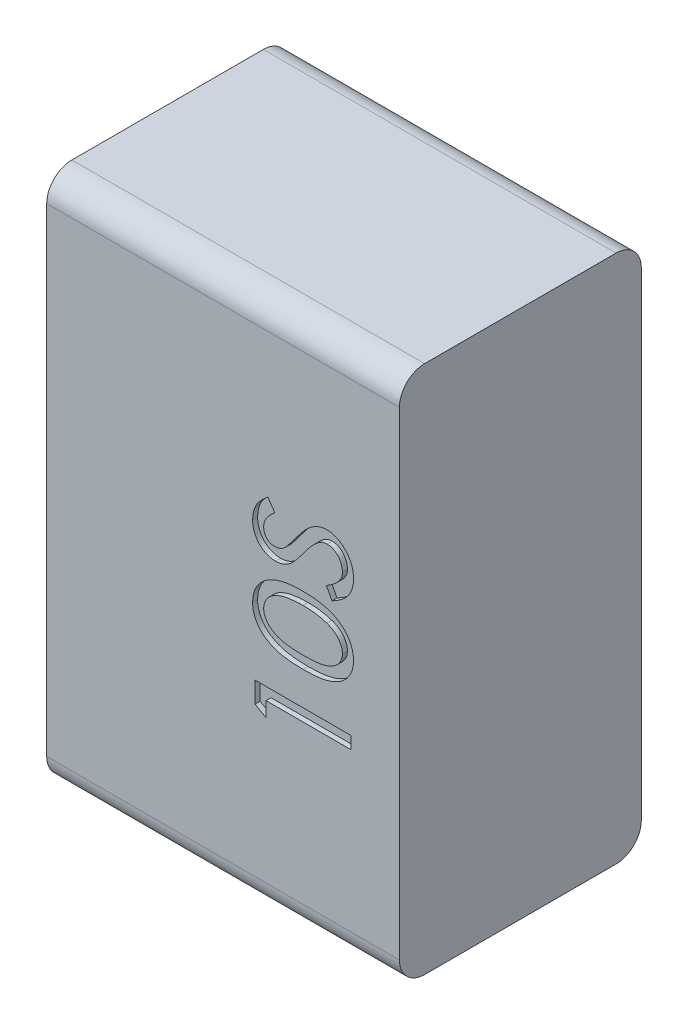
ISO-10303-21;
HEADER;
FILE_DESCRIPTION(('STEP AP214'),'2;1');
FILE_NAME('part.step','',(''),(''),'','','');
FILE_SCHEMA(('AUTOMOTIVE_DESIGN { 1 0 10303 214 1 1 1 1 }'));
ENDSEC;
DATA;
#1=APPLICATION_CONTEXT('core data for automotive mechanical design processes');
#2=APPLICATION_PROTOCOL_DEFINITION('international standard','automotive_design',2000,#1);
#3=PRODUCT_CONTEXT('',#1,'mechanical');
#4=PRODUCT('Part','Part','',(#3));
#5=PRODUCT_RELATED_PRODUCT_CATEGORY('part','',(#4));
#6=PRODUCT_DEFINITION_FORMATION('','',#4);
#7=PRODUCT_DEFINITION_CONTEXT('part definition',#1,'design');
#8=PRODUCT_DEFINITION('design','',#6,#7);
#9=PRODUCT_DEFINITION_SHAPE('','',#8);
#10=(LENGTH_UNIT() NAMED_UNIT(*) SI_UNIT(.MILLI.,.METRE.));
#11=(NAMED_UNIT(*) PLANE_ANGLE_UNIT() SI_UNIT($,.RADIAN.));
#12=(NAMED_UNIT(*) SI_UNIT($,.STERADIAN.) SOLID_ANGLE_UNIT());
#13=UNCERTAINTY_MEASURE_WITH_UNIT(LENGTH_MEASURE(1.E-05),#10,'distance_accuracy_value','');
#14=(GEOMETRIC_REPRESENTATION_CONTEXT(3) GLOBAL_UNCERTAINTY_ASSIGNED_CONTEXT((#13)) GLOBAL_UNIT_ASSIGNED_CONTEXT((#10,
#11,#12)) REPRESENTATION_CONTEXT('',''));
#15=CARTESIAN_POINT('',(0.,0.,0.));
#16=DIRECTION('',(0.,0.,1.));
#17=DIRECTION('',(1.,0.,0.));
#18=AXIS2_PLACEMENT_3D('',#15,#16,#17);
#19=CARTESIAN_POINT('',(0.,0.,24.));
#20=DIRECTION('',(0.,0.,-1.));
#21=DIRECTION('',(-1.,0.,0.));
#22=AXIS2_PLACEMENT_3D('',#19,#20,#21);
#23=PLANE('',#22);
#24=CARTESIAN_POINT('',(25.8859039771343,-0.624698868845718,24.));
#25=CARTESIAN_POINT('',(25.8832865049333,-0.77874704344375,24.));
#26=CARTESIAN_POINT('',(25.8781024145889,-1.0838504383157,24.));
#27=CARTESIAN_POINT('',(25.8272550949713,-1.53438338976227,24.));
#28=CARTESIAN_POINT('',(25.7428745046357,-1.97327169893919,24.));
#29=CARTESIAN_POINT('',(25.6245826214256,-2.39920472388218,24.));
#30=CARTESIAN_POINT('',(25.4745017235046,-2.8152553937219,24.));
#31=CARTESIAN_POINT('',(25.2923120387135,-3.21931906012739,24.));
#32=CARTESIAN_POINT('',(25.0728220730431,-3.61048550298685,24.));
#33=CARTESIAN_POINT('',(24.8206712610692,-3.98748757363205,24.));
#34=CARTESIAN_POINT('',(24.5393974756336,-4.35003920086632,24.));
#35=CARTESIAN_POINT('',(24.2253538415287,-4.69229074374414,24.));
#36=CARTESIAN_POINT('',(23.8742563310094,-5.00801475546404,24.));
#37=CARTESIAN_POINT('',(23.4979515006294,-5.31055273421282,24.));
#38=CARTESIAN_POINT('',(23.0873923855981,-5.59043898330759,24.));
#39=CARTESIAN_POINT('',(22.6430418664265,-5.84455584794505,24.));
#40=CARTESIAN_POINT('',(22.1681091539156,-6.08226441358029,24.));
#41=CARTESIAN_POINT('',(21.6588799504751,-6.29991808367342,24.));
#42=CARTESIAN_POINT('',(21.1100352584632,-6.49840169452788,24.));
#43=CARTESIAN_POINT('',(20.5098289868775,-6.65764466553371,24.));
#44=CARTESIAN_POINT('',(19.8630237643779,-6.8059515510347,24.));
#45=CARTESIAN_POINT('',(19.1625122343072,-6.91546469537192,24.));
#46=CARTESIAN_POINT('',(18.4145784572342,-7.01032310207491,24.));
#47=CARTESIAN_POINT('',(17.61442522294,-7.06539089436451,24.));
#48=CARTESIAN_POINT('',(16.7646892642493,-7.11243713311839,24.));
#49=CARTESIAN_POINT('',(16.1803524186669,-7.11472110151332,24.));
#50=CARTESIAN_POINT('',(15.8800746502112,-7.11589478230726,24.));
#51=B_SPLINE_CURVE_WITH_KNOTS('',3,(#24,#25,#26,#27,#28,#29,#30,#31,#32,#33,#34,#35,#36,#37,#38,
#39,#40,#41,#42,#43,#44,#45,#46,#47,#48,#49,#50),.UNSPECIFIED.,.F.,.F.,(4,1,1,1,1,1,1,1,1,1,1,1,
1,1,1,1,1,1,1,1,1,1,1,1,4),(0.,0.0344246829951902,0.0681805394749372,0.101194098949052,
0.134238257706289,0.166888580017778,0.199975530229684,0.233200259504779,0.267032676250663,
0.301273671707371,0.335684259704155,0.370706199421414,0.406720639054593,0.443551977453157,
0.481642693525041,0.521063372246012,0.562208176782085,0.605378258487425,0.651390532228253,
0.700922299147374,0.753652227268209,0.809800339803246,0.86940258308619,0.932888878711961,1.),.UNSPECIFIED.);
#52=CARTESIAN_POINT('',(25.8859039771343,-0.624698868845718,24.));
#53=VERTEX_POINT('',#52);
#54=CARTESIAN_POINT('',(15.8800746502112,-7.11589478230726,24.));
#55=VERTEX_POINT('',#54);
#56=EDGE_CURVE('E56',#53,#55,#51,.T.);
#57=ORIENTED_EDGE('',*,*,#56,.T.);
#58=CARTESIAN_POINT('',(15.8800746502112,-7.11589478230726,24.));
#59=CARTESIAN_POINT('',(15.5772921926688,-7.11407974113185,24.));
#60=CARTESIAN_POINT('',(14.9892768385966,-7.11055486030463,24.));
#61=CARTESIAN_POINT('',(14.1338748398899,-7.07246253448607,24.));
#62=CARTESIAN_POINT('',(13.3309161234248,-7.00697618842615,24.));
#63=CARTESIAN_POINT('',(12.5792882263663,-6.92201414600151,24.));
#64=CARTESIAN_POINT('',(11.8804340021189,-6.80701109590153,24.));
#65=CARTESIAN_POINT('',(11.2327580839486,-6.67117175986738,24.));
#66=CARTESIAN_POINT('',(10.6367993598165,-6.50895855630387,24.));
#67=CARTESIAN_POINT('',(10.0908094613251,-6.31616951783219,24.));
#68=CARTESIAN_POINT('',(9.58651617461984,-6.10092227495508,24.));
#69=CARTESIAN_POINT('',(9.11700775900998,-5.86368231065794,24.));
#70=CARTESIAN_POINT('',(8.6758674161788,-5.60852693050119,24.));
#71=CARTESIAN_POINT('',(8.26614030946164,-5.32953194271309,24.));
#72=CARTESIAN_POINT('',(7.88835829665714,-5.02729540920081,24.));
#73=CARTESIAN_POINT('',(7.53853243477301,-4.70622178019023,24.));
#74=CARTESIAN_POINT('',(7.2208825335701,-4.36149763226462,24.));
#75=CARTESIAN_POINT('',(6.93510752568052,-3.99633936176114,24.));
#76=CARTESIAN_POINT('',(6.6843250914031,-3.61302217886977,24.));
#77=CARTESIAN_POINT('',(6.4601010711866,-3.2213359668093,24.));
#78=CARTESIAN_POINT('',(6.27830527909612,-2.81337405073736,24.));
#79=CARTESIAN_POINT('',(6.12385480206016,-2.3972503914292,24.));
#80=CARTESIAN_POINT('',(6.00568809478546,-1.96941559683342,24.));
#81=CARTESIAN_POINT('',(5.92268135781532,-1.53029572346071,24.));
#82=CARTESIAN_POINT('',(5.86564834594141,-1.08158759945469,24.));
#83=CARTESIAN_POINT('',(5.86121105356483,-0.777520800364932,24.));
#84=CARTESIAN_POINT('',(5.85898090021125,-0.624698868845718,24.));
#85=B_SPLINE_CURVE_WITH_KNOTS('',3,(#58,#59,#60,#61,#62,#63,#64,#65,#66,#67,#68,#69,#70,#71,#72,
#73,#74,#75,#76,#77,#78,#79,#80,#81,#82,#83,#84),.UNSPECIFIED.,.F.,.F.,(4,1,1,1,1,1,1,1,1,1,1,1,
1,1,1,1,1,1,1,1,1,1,1,1,4),(0.,0.0675968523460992,0.13127572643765,0.19111036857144,
0.247437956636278,0.300103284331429,0.349175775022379,0.395131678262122,0.437886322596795,
0.478346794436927,0.517465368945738,0.555263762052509,0.592049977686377,0.628020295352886,
0.663191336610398,0.697961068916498,0.732558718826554,0.766586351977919,0.800157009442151,
0.833203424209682,0.866177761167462,0.899181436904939,0.93215455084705,0.965901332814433,1.),.UNSPECIFIED.);
#86=CARTESIAN_POINT('',(5.85898090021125,-0.624698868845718,24.));
#87=VERTEX_POINT('',#86);
#88=EDGE_CURVE('E376',#55,#87,#85,.T.);
#89=ORIENTED_EDGE('',*,*,#88,.T.);
#90=CARTESIAN_POINT('',(5.85898090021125,-0.624698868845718,24.));
#91=CARTESIAN_POINT('',(5.86321172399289,-0.457950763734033,24.));
#92=CARTESIAN_POINT('',(5.87156261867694,-0.1288196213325,24.));
#93=CARTESIAN_POINT('',(5.92100119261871,0.358786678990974,24.));
#94=CARTESIAN_POINT('',(6.00769607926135,0.832725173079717,24.));
#95=CARTESIAN_POINT('',(6.13700172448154,1.29170512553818,24.));
#96=CARTESIAN_POINT('',(6.2906894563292,1.74026342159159,24.));
#97=CARTESIAN_POINT('',(6.48727706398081,2.17200595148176,24.));
#98=CARTESIAN_POINT('',(6.71798279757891,2.58970368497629,24.));
#99=CARTESIAN_POINT('',(6.97978188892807,2.99448469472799,24.));
#100=CARTESIAN_POINT('',(7.27955081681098,3.37898214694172,24.));
#101=CARTESIAN_POINT('',(7.60557317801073,3.74817585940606,24.));
#102=CARTESIAN_POINT('',(7.97254677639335,4.08496947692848,24.));
#103=CARTESIAN_POINT('',(8.3600732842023,4.4103546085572,24.));
#104=CARTESIAN_POINT('',(8.78744942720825,4.70000194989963,24.));
#105=CARTESIAN_POINT('',(9.23709913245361,4.97968499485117,24.));
#106=CARTESIAN_POINT('',(9.72517556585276,5.2238181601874,24.));
#107=CARTESIAN_POINT('',(10.2409858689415,5.45700822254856,24.));
#108=CARTESIAN_POINT('',(10.7981863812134,5.65706790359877,24.));
#109=CARTESIAN_POINT('',(11.394412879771,5.83899055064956,24.));
#110=CARTESIAN_POINT('',(12.0365040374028,5.98464185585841,24.));
#111=CARTESIAN_POINT('',(12.7215677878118,6.10713216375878,24.));
#112=CARTESIAN_POINT('',(13.4501147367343,6.20087799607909,24.));
#113=CARTESIAN_POINT('',(14.2214576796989,6.2702478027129,24.));
#114=CARTESIAN_POINT('',(15.0363690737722,6.30643462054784,24.));
#115=CARTESIAN_POINT('',(15.5938359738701,6.3132817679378,24.));
#116=CARTESIAN_POINT('',(15.8800746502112,6.31679752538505,24.));
#117=B_SPLINE_CURVE_WITH_KNOTS('',3,(#90,#91,#92,#93,#94,#95,#96,#97,#98,#99,#100,#101,#102,
#103,#104,#105,#106,#107,#108,#109,#110,#111,#112,#113,#114,#115,#116),.UNSPECIFIED.,.F.,.F.,(4,
1,1,1,1,1,1,1,1,1,1,1,1,1,1,1,1,1,1,1,1,1,1,1,4),(0.,0.0364555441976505,0.0719567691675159,
0.107027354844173,0.141636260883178,0.176111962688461,0.210587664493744,0.245187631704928,
0.280359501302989,0.315846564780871,0.351688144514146,0.387888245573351,0.42463324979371,
0.462200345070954,0.500640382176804,0.540313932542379,0.581396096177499,0.624327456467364,
0.669634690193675,0.717595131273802,0.768161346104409,0.821728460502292,0.878124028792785,
0.937421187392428,1.),.UNSPECIFIED.);
#118=CARTESIAN_POINT('',(15.8800746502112,6.31679752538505,24.));
#119=VERTEX_POINT('',#118);
#120=EDGE_CURVE('E385',#87,#119,#117,.T.);
#121=ORIENTED_EDGE('',*,*,#120,.T.);
#122=CARTESIAN_POINT('',(15.8800746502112,6.31679752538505,24.));
#123=CARTESIAN_POINT('',(16.1650370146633,6.31324548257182,24.));
#124=CARTESIAN_POINT('',(16.719952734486,6.3063284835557,24.));
#125=CARTESIAN_POINT('',(17.5311132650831,6.27065344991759,24.));
#126=CARTESIAN_POINT('',(18.2982671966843,6.19951381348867,24.));
#127=CARTESIAN_POINT('',(19.0235840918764,6.11197470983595,24.));
#128=CARTESIAN_POINT('',(19.7048048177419,5.98900042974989,24.));
#129=CARTESIAN_POINT('',(20.3412930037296,5.84016101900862,24.));
#130=CARTESIAN_POINT('',(20.9369575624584,5.67127158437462,24.));
#131=CARTESIAN_POINT('',(21.4881932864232,5.46563235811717,24.));
#132=CARTESIAN_POINT('',(22.0051739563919,5.24193738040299,24.));
#133=CARTESIAN_POINT('',(22.4881549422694,4.99096796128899,24.));
#134=CARTESIAN_POINT('',(22.9442633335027,4.72352519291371,24.));
#135=CARTESIAN_POINT('',(23.362977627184,4.42122074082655,24.));
#136=CARTESIAN_POINT('',(23.7603244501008,4.10809881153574,24.));
#137=CARTESIAN_POINT('',(24.116731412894,3.76000344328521,24.));
#138=CARTESIAN_POINT('',(24.4535956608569,3.39973173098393,24.));
#139=CARTESIAN_POINT('',(24.7477170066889,3.00847434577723,24.));
#140=CARTESIAN_POINT('',(25.0165793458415,2.60463771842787,24.));
#141=CARTESIAN_POINT('',(25.2507553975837,2.18436485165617,24.));
#142=CARTESIAN_POINT('',(25.4445619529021,1.74791589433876,24.));
#143=CARTESIAN_POINT('',(25.6052001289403,1.30023245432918,24.));
#144=CARTESIAN_POINT('',(25.7338614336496,0.839085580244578,24.));
#145=CARTESIAN_POINT('',(25.8187787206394,0.362325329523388,24.));
#146=CARTESIAN_POINT('',(25.8744786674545,-0.127294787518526,24.));
#147=CARTESIAN_POINT('',(25.8820728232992,-0.457908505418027,24.));
#148=CARTESIAN_POINT('',(25.8859039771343,-0.624698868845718,24.));
#149=B_SPLINE_CURVE_WITH_KNOTS('',3,(#122,#123,#124,#125,#126,#127,#128,#129,#130,#131,#132,
#133,#134,#135,#136,#137,#138,#139,#140,#141,#142,#143,#144,#145,#146,#147,#148),.UNSPECIFIED.,
.F.,.F.,(4,1,1,1,1,1,1,1,1,1,1,1,1,1,1,1,1,1,1,1,1,1,1,1,4),(0.,0.0623644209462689,
0.12144409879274,0.177620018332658,0.230930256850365,0.281274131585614,0.329012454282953,
0.373941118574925,0.416654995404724,0.45766686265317,0.497133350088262,0.535707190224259,
0.573244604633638,0.610067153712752,0.646293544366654,0.682152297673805,0.717896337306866,
0.753256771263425,0.788270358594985,0.823035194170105,0.857639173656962,0.892283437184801,
0.927663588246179,0.963507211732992,1.),.UNSPECIFIED.);
#150=EDGE_CURVE('E393',#119,#53,#149,.T.);
#151=ORIENTED_EDGE('',*,*,#150,.T.);
#152=EDGE_LOOP('',(#57,#89,#121,#151));
#153=FACE_BOUND('',#152,.T.);
#154=DIRECTION('',(0.,-1.,0.));
#155=VECTOR('',#154,1.);
#156=CARTESIAN_POINT('',(-35.,52.5,24.));
#157=LINE('',#156,#155);
#158=CARTESIAN_POINT('',(-35.,47.5,24.));
#159=VERTEX_POINT('',#158);
#160=CARTESIAN_POINT('',(-35.,-47.5,24.));
#161=VERTEX_POINT('',#160);
#162=EDGE_CURVE('E458',#159,#161,#157,.T.);
#163=ORIENTED_EDGE('',*,*,#162,.T.);
#164=DIRECTION('',(1.,0.,0.));
#165=VECTOR('',#164,1.);
#166=CARTESIAN_POINT('',(0.,-47.5,24.));
#167=LINE('',#166,#165);
#168=CARTESIAN_POINT('',(35.,-47.5,24.));
#169=VERTEX_POINT('',#168);
#170=EDGE_CURVE('E506',#161,#169,#167,.T.);
#171=ORIENTED_EDGE('',*,*,#170,.T.);
#172=DIRECTION('',(0.,1.,0.));
#173=VECTOR('',#172,1.);
#174=CARTESIAN_POINT('',(35.,52.5,24.));
#175=LINE('',#174,#173);
#176=CARTESIAN_POINT('',(35.,47.5,24.));
#177=VERTEX_POINT('',#176);
#178=EDGE_CURVE('E461',#169,#177,#175,.T.);
#179=ORIENTED_EDGE('',*,*,#178,.T.);
#180=DIRECTION('',(-1.,0.,0.));
#181=VECTOR('',#180,1.);
#182=CARTESIAN_POINT('',(0.,47.5,24.));
#183=LINE('',#182,#181);
#184=EDGE_CURVE('E503',#177,#159,#183,.T.);
#185=ORIENTED_EDGE('',*,*,#184,.T.);
#186=EDGE_LOOP('',(#163,#171,#179,#185));
#187=FACE_BOUND('',#186,.T.);
#188=DIRECTION('',(-0.872867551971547,0.487957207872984,0.));
#189=VECTOR('',#188,1.);
#190=CARTESIAN_POINT('',(8.54551936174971,-19.0832024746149,24.));
#191=LINE('',#190,#189);
#192=CARTESIAN_POINT('',(8.54551936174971,-19.0832024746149,24.));
#193=VERTEX_POINT('',#192);
#194=CARTESIAN_POINT('',(6.34744243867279,-17.8544164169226,24.));
#195=VERTEX_POINT('',#194);
#196=EDGE_CURVE('E427',#193,#195,#191,.T.);
#197=ORIENTED_EDGE('',*,*,#196,.T.);
#198=DIRECTION('',(0.,1.,0.));
#199=VECTOR('',#198,1.);
#200=CARTESIAN_POINT('',(6.34744243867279,-17.8544164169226,24.));
#201=LINE('',#200,#199);
#202=CARTESIAN_POINT('',(6.34744243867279,-13.710125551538,24.));
#203=VERTEX_POINT('',#202);
#204=EDGE_CURVE('E430',#195,#203,#201,.T.);
#205=ORIENTED_EDGE('',*,*,#204,.T.);
#206=DIRECTION('',(1.,0.,0.));
#207=VECTOR('',#206,1.);
#208=CARTESIAN_POINT('',(6.34744243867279,-13.710125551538,24.));
#209=LINE('',#208,#207);
#210=CARTESIAN_POINT('',(25.3974424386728,-13.710125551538,24.));
#211=VERTEX_POINT('',#210);
#212=EDGE_CURVE('E433',#203,#211,#209,.T.);
#213=ORIENTED_EDGE('',*,*,#212,.T.);
#214=DIRECTION('',(0.,-1.,0.));
#215=VECTOR('',#214,1.);
#216=CARTESIAN_POINT('',(25.3974424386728,-13.710125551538,24.));
#217=LINE('',#216,#215);
#218=CARTESIAN_POINT('',(25.3974424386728,-16.1524332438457,24.));
#219=VERTEX_POINT('',#218);
#220=EDGE_CURVE('E436',#211,#219,#217,.T.);
#221=ORIENTED_EDGE('',*,*,#220,.T.);
#222=DIRECTION('',(-1.,0.,0.));
#223=VECTOR('',#222,1.);
#224=CARTESIAN_POINT('',(25.3974424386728,-16.1524332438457,24.));
#225=LINE('',#224,#223);
#226=CARTESIAN_POINT('',(8.54551936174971,-16.1524332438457,24.));
#227=VERTEX_POINT('',#226);
#228=EDGE_CURVE('E439',#219,#227,#225,.T.);
#229=ORIENTED_EDGE('',*,*,#228,.T.);
#230=DIRECTION('',(0.,-1.,0.));
#231=VECTOR('',#230,1.);
#232=CARTESIAN_POINT('',(8.54551936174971,-16.1524332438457,24.));
#233=LINE('',#232,#231);
#234=EDGE_CURVE('E416',#227,#193,#233,.T.);
#235=ORIENTED_EDGE('',*,*,#234,.T.);
#236=EDGE_LOOP('',(#197,#205,#213,#221,#229,#235));
#237=FACE_BOUND('',#236,.T.);
#238=CARTESIAN_POINT('',(25.8859039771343,13.4490992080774,24.));
#239=CARTESIAN_POINT('',(25.8826248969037,13.3014678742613,24.));
#240=CARTESIAN_POINT('',(25.8761664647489,13.0106951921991,24.));
#241=CARTESIAN_POINT('',(25.8351994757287,12.579020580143,24.));
#242=CARTESIAN_POINT('',(25.7564613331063,12.1589474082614,24.));
#243=CARTESIAN_POINT('',(25.6546608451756,11.7481725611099,24.));
#244=CARTESIAN_POINT('',(25.5250316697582,11.3464396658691,24.));
#245=CARTESIAN_POINT('',(25.3592121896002,10.9589259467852,24.));
#246=CARTESIAN_POINT('',(25.1687455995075,10.5791784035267,24.));
#247=CARTESIAN_POINT('',(24.9457289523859,10.2093754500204,24.));
#248=CARTESIAN_POINT('',(24.684594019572,9.84904551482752,24.));
#249=CARTESIAN_POINT('',(24.3814677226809,9.49614089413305,24.));
#250=CARTESIAN_POINT('',(24.0310214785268,9.152711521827,24.));
#251=CARTESIAN_POINT('',(23.637808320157,8.81287028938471,24.));
#252=CARTESIAN_POINT('',(23.1974054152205,8.48110694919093,24.));
#253=CARTESIAN_POINT('',(22.7121285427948,8.1581960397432,24.));
#254=CARTESIAN_POINT('',(22.1835425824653,7.84001456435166,24.));
#255=CARTESIAN_POINT('',(21.8112184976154,7.64062368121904,24.));
#256=CARTESIAN_POINT('',(21.6194977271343,7.5379513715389,24.));
#257=B_SPLINE_CURVE_WITH_KNOTS('',3,(#238,#239,#240,#241,#242,#243,#244,#245,#246,#247,#248,
#249,#250,#251,#252,#253,#254,#255,#256),.UNSPECIFIED.,.F.,.F.,(4,1,1,1,1,1,1,1,1,1,1,1,1,1,1,1,
4),(0.,0.057308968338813,0.112874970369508,0.168077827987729,0.223043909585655,
0.277068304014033,0.331723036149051,0.386484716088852,0.441863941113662,0.499147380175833,
0.559021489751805,0.622215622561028,0.689427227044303,0.760626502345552,0.836081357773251,
0.91559340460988,1.),.UNSPECIFIED.);
#258=CARTESIAN_POINT('',(25.8859039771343,13.4490992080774,24.));
#259=VERTEX_POINT('',#258);
#260=CARTESIAN_POINT('',(21.6194977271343,7.5379513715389,24.));
#261=VERTEX_POINT('',#260);
#262=EDGE_CURVE('E48',#259,#261,#257,.T.);
#263=ORIENTED_EDGE('',*,*,#262,.T.);
#264=DIRECTION('',(-0.470419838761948,0.882442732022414,0.));
#265=VECTOR('',#264,1.);
#266=CARTESIAN_POINT('',(21.6194977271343,7.5379513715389,24.));
#267=LINE('',#266,#265);
#268=CARTESIAN_POINT('',(20.5128270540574,9.61391291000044,24.));
#269=VERTEX_POINT('',#268);
#270=EDGE_CURVE('E312',#261,#269,#267,.T.);
#271=ORIENTED_EDGE('',*,*,#270,.T.);
#272=CARTESIAN_POINT('',(20.5128270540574,9.61391291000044,24.));
#273=CARTESIAN_POINT('',(20.7634222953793,9.76519990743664,24.));
#274=CARTESIAN_POINT('',(21.2423792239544,10.0543512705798,24.));
#275=CARTESIAN_POINT('',(21.8875910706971,10.5291524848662,24.));
#276=CARTESIAN_POINT('',(22.4377872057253,11.0012334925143,24.));
#277=CARTESIAN_POINT('',(22.892412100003,11.4752542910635,24.));
#278=CARTESIAN_POINT('',(23.2441631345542,11.9577993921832,24.));
#279=CARTESIAN_POINT('',(23.4983809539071,12.4439425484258,24.));
#280=CARTESIAN_POINT('',(23.6581653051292,12.936726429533,24.));
#281=CARTESIAN_POINT('',(23.6780461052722,13.2699135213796,24.));
#282=CARTESIAN_POINT('',(23.6878270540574,13.4338347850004,24.));
#283=B_SPLINE_CURVE_WITH_KNOTS('',3,(#272,#273,#274,#275,#276,#277,#278,#279,#280,#281,#282),
.UNSPECIFIED.,.F.,.F.,(4,1,1,1,1,1,1,1,4),(0.,0.169367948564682,0.323709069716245,
0.463075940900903,0.588607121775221,0.703049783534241,0.807443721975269,0.905266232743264,1.),.UNSPECIFIED.);
#284=CARTESIAN_POINT('',(23.6878270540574,13.4338347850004,24.));
#285=VERTEX_POINT('',#284);
#286=EDGE_CURVE('E696',#269,#285,#283,.T.);
#287=ORIENTED_EDGE('',*,*,#286,.T.);
#288=CARTESIAN_POINT('',(23.6878270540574,13.4338347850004,24.));
#289=CARTESIAN_POINT('',(23.682932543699,13.5868745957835,24.));
#290=CARTESIAN_POINT('',(23.6732379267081,13.8900024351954,24.));
#291=CARTESIAN_POINT('',(23.5883834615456,14.3352060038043,24.));
#292=CARTESIAN_POINT('',(23.4608405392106,14.7675077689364,24.));
#293=CARTESIAN_POINT('',(23.2721294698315,15.1753937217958,24.));
#294=CARTESIAN_POINT('',(23.0479931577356,15.5533381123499,24.));
#295=CARTESIAN_POINT('',(22.7850560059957,15.8898771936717,24.));
#296=CARTESIAN_POINT('',(22.4821750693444,16.1719129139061,24.));
#297=CARTESIAN_POINT('',(22.1488351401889,16.4059214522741,24.));
#298=CARTESIAN_POINT('',(21.7933905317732,16.5878499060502,24.));
#299=CARTESIAN_POINT('',(21.4254602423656,16.7250661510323,24.));
#300=CARTESIAN_POINT('',(21.0426579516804,16.8023236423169,24.));
#301=CARTESIAN_POINT('',(20.784093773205,16.8132327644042,24.));
#302=CARTESIAN_POINT('',(20.6540229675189,16.8187206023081,24.));
#303=B_SPLINE_CURVE_WITH_KNOTS('',3,(#288,#289,#290,#291,#292,#293,#294,#295,#296,#297,#298,
#299,#300,#301,#302),.UNSPECIFIED.,.F.,.F.,(4,1,1,1,1,1,1,1,1,1,1,1,4),(0.,0.0907498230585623,
0.179749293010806,0.268115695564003,0.357651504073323,0.445694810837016,0.528465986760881,
0.61018725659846,0.690405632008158,0.769417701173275,0.846560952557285,0.922812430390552,1.),.UNSPECIFIED.);
#304=CARTESIAN_POINT('',(20.6540229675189,16.8187206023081,24.));
#305=VERTEX_POINT('',#304);
#306=EDGE_CURVE('E713',#285,#305,#303,.T.);
#307=ORIENTED_EDGE('',*,*,#306,.T.);
#308=CARTESIAN_POINT('',(20.6540229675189,16.8187206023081,24.));
#309=CARTESIAN_POINT('',(20.5057431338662,16.8112376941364,24.));
#310=CARTESIAN_POINT('',(20.2061035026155,16.7961164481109,24.));
#311=CARTESIAN_POINT('',(19.760985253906,16.674749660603,24.));
#312=CARTESIAN_POINT('',(19.3202222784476,16.4775064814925,24.));
#313=CARTESIAN_POINT('',(19.0450261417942,16.2950520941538,24.));
#314=CARTESIAN_POINT('',(18.902430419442,16.2005114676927,24.));
#315=B_SPLINE_CURVE_WITH_KNOTS('',3,(#308,#309,#310,#311,#312,#313,#314),.UNSPECIFIED.,.F.,.F.,
(4,1,1,1,4),(0.,0.235465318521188,0.475821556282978,0.728391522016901,1.),.UNSPECIFIED.);
#316=CARTESIAN_POINT('',(18.902430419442,16.2005114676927,24.));
#317=VERTEX_POINT('',#316);
#318=EDGE_CURVE('E721',#305,#317,#315,.T.);
#319=ORIENTED_EDGE('',*,*,#318,.T.);
#320=CARTESIAN_POINT('',(18.902430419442,16.2005114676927,24.));
#321=CARTESIAN_POINT('',(18.7986174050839,16.118774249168,24.));
#322=CARTESIAN_POINT('',(18.5800821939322,15.9467104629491,24.));
#323=CARTESIAN_POINT('',(18.2513591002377,15.6551915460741,24.));
#324=CARTESIAN_POINT('',(17.9077483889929,15.3159030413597,24.));
#325=CARTESIAN_POINT('',(17.5564401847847,14.9219888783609,24.));
#326=CARTESIAN_POINT('',(17.1751815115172,14.4942646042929,24.));
#327=CARTESIAN_POINT('',(16.7887886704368,14.0108283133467,24.));
#328=CARTESIAN_POINT('',(16.3836159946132,13.4836030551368,24.));
#329=CARTESIAN_POINT('',(16.1121393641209,13.1138228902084,24.));
#330=CARTESIAN_POINT('',(15.9716611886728,12.9224766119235,24.));
#331=B_SPLINE_CURVE_WITH_KNOTS('',3,(#320,#321,#322,#323,#324,#325,#326,#327,#328,#329,#330),
.UNSPECIFIED.,.F.,.F.,(4,1,1,1,1,1,1,1,4),(0.,0.0898256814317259,0.189090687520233,
0.298565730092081,0.417951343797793,0.547889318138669,0.688100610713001,0.838604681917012,1.),.UNSPECIFIED.);
#332=CARTESIAN_POINT('',(15.9716611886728,12.9224766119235,24.));
#333=VERTEX_POINT('',#332);
#334=EDGE_CURVE('E729',#317,#333,#331,.T.);
#335=ORIENTED_EDGE('',*,*,#334,.T.);
#336=CARTESIAN_POINT('',(15.9716611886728,12.9224766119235,24.));
#337=CARTESIAN_POINT('',(15.8298335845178,12.7273818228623,24.));
#338=CARTESIAN_POINT('',(15.557706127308,12.3530495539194,24.));
#339=CARTESIAN_POINT('',(15.1587660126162,11.8256480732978,24.));
#340=CARTESIAN_POINT('',(14.7909211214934,11.3527813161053,24.));
#341=CARTESIAN_POINT('',(14.4538839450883,10.9380754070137,24.));
#342=CARTESIAN_POINT('',(14.1447251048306,10.581483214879,24.));
#343=CARTESIAN_POINT('',(13.8647132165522,10.2837559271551,24.));
#344=CARTESIAN_POINT('',(13.6215325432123,10.0359307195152,24.));
#345=CARTESIAN_POINT('',(13.4579091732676,9.90275651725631,24.));
#346=CARTESIAN_POINT('',(13.3843414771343,9.84287925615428,24.));
#347=B_SPLINE_CURVE_WITH_KNOTS('',3,(#336,#337,#338,#339,#340,#341,#342,#343,#344,#345,#346),
.UNSPECIFIED.,.F.,.F.,(4,1,1,1,1,1,1,1,4),(0.,0.179479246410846,0.344370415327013,
0.492060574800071,0.625259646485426,0.741997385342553,0.843119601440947,0.929464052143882,1.),.UNSPECIFIED.);
#348=CARTESIAN_POINT('',(13.3843414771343,9.84287925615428,24.));
#349=VERTEX_POINT('',#348);
#350=EDGE_CURVE('E737',#333,#349,#347,.T.);
#351=ORIENTED_EDGE('',*,*,#350,.T.);
#352=CARTESIAN_POINT('',(13.3843414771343,9.84287925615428,24.));
#353=CARTESIAN_POINT('',(13.2713957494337,9.75546654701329,24.));
#354=CARTESIAN_POINT('',(13.0495047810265,9.58373724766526,24.));
#355=CARTESIAN_POINT('',(12.6935772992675,9.36632201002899,24.));
#356=CARTESIAN_POINT('',(12.3329915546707,9.17924106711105,24.));
#357=CARTESIAN_POINT('',(11.9644087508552,9.02515216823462,24.));
#358=CARTESIAN_POINT('',(11.5890063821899,8.90574255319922,24.));
#359=CARTESIAN_POINT('',(11.2054679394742,8.82359438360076,24.));
#360=CARTESIAN_POINT('',(10.8153169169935,8.76564849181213,24.));
#361=CARTESIAN_POINT('',(10.551732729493,8.76129416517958,24.));
#362=CARTESIAN_POINT('',(10.419227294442,8.75910521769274,24.));
#363=B_SPLINE_CURVE_WITH_KNOTS('',3,(#352,#353,#354,#355,#356,#357,#358,#359,#360,#361,#362),
.UNSPECIFIED.,.F.,.F.,(4,1,1,1,1,1,1,1,4),(0.,0.133013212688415,0.261315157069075,
0.388035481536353,0.511326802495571,0.633179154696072,0.754563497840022,0.876617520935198,1.),.UNSPECIFIED.);
#364=CARTESIAN_POINT('',(10.419227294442,8.75910521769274,24.));
#365=VERTEX_POINT('',#364);
#366=EDGE_CURVE('E745',#349,#365,#363,.T.);
#367=ORIENTED_EDGE('',*,*,#366,.T.);
#368=CARTESIAN_POINT('',(10.419227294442,8.75910521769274,24.));
#369=CARTESIAN_POINT('',(10.2125717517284,8.76595527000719,24.));
#370=CARTESIAN_POINT('',(9.80340889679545,8.77951787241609,24.));
#371=CARTESIAN_POINT('',(9.20517961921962,8.90235303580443,24.));
#372=CARTESIAN_POINT('',(8.63417237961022,9.09827764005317,24.));
#373=CARTESIAN_POINT('',(8.09551733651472,9.36934377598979,24.));
#374=CARTESIAN_POINT('',(7.59854689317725,9.71226297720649,24.));
#375=CARTESIAN_POINT('',(7.15641526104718,10.1247415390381,24.));
#376=CARTESIAN_POINT('',(6.77077557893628,10.6004162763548,24.));
#377=CARTESIAN_POINT('',(6.44622809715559,11.1326812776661,24.));
#378=CARTESIAN_POINT('',(6.18277787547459,11.7060737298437,24.));
#379=CARTESIAN_POINT('',(5.99506186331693,12.3100774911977,24.));
#380=CARTESIAN_POINT('',(5.88124772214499,12.9372646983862,24.));
#381=CARTESIAN_POINT('',(5.86645817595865,13.3634013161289,24.));
#382=CARTESIAN_POINT('',(5.85898090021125,13.5788468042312,24.));
#383=B_SPLINE_CURVE_WITH_KNOTS('',3,(#368,#369,#370,#371,#372,#373,#374,#375,#376,#377,#378,
#379,#380,#381,#382),.UNSPECIFIED.,.F.,.F.,(4,1,1,1,1,1,1,1,1,1,1,1,4),(0.,0.0837017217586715,
0.165723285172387,0.246450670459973,0.327862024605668,0.409400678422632,0.490405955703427,
0.572154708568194,0.656885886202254,0.742500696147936,0.827316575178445,0.912694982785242,1.),.UNSPECIFIED.);
#384=CARTESIAN_POINT('',(5.85898090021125,13.5788468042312,24.));
#385=VERTEX_POINT('',#384);
#386=EDGE_CURVE('E753',#365,#385,#383,.T.);
#387=ORIENTED_EDGE('',*,*,#386,.T.);
#388=CARTESIAN_POINT('',(5.85898090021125,13.5788468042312,24.));
#389=CARTESIAN_POINT('',(5.86719545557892,13.823578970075,24.));
#390=CARTESIAN_POINT('',(5.88347155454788,14.3084846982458,24.));
#391=CARTESIAN_POINT('',(6.00889608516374,15.0209505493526,24.));
#392=CARTESIAN_POINT('',(6.21264717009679,15.7058480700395,24.));
#393=CARTESIAN_POINT('',(6.44795147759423,16.2550132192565,24.));
#394=CARTESIAN_POINT('',(6.68647975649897,16.6823492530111,24.));
#395=CARTESIAN_POINT('',(6.90220326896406,17.0054830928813,24.));
#396=CARTESIAN_POINT('',(7.14625996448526,17.3366990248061,24.));
#397=CARTESIAN_POINT('',(7.4309114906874,17.6654807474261,24.));
#398=CARTESIAN_POINT('',(7.74235795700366,18.0046499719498,24.));
#399=CARTESIAN_POINT('',(8.09753701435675,18.3368363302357,24.));
#400=CARTESIAN_POINT('',(8.4760905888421,18.6830627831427,24.));
#401=CARTESIAN_POINT('',(8.7490939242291,18.9037348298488,24.));
#402=CARTESIAN_POINT('',(8.88896888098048,19.0167975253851,24.));
#403=B_SPLINE_CURVE_WITH_KNOTS('',3,(#388,#389,#390,#391,#392,#393,#394,#395,#396,#397,#398,
#399,#400,#401,#402),.UNSPECIFIED.,.F.,.F.,(4,1,1,1,1,1,1,1,1,1,1,1,4),(0.,0.113390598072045,
0.22466907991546,0.334173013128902,0.444031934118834,0.500784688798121,0.560800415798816,
0.624006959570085,0.691349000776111,0.762268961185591,0.837332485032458,0.916656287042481,1.),.UNSPECIFIED.);
#404=CARTESIAN_POINT('',(8.88896888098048,19.0167975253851,24.));
#405=VERTEX_POINT('',#404);
#406=EDGE_CURVE('E761',#385,#405,#403,.T.);
#407=ORIENTED_EDGE('',*,*,#406,.T.);
#408=DIRECTION('',(0.565589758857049,-0.824686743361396,0.));
#409=VECTOR('',#408,1.);
#410=CARTESIAN_POINT('',(8.88896888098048,19.0167975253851,24.));
#411=LINE('',#410,#409);
#412=CARTESIAN_POINT('',(10.2551347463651,17.0247903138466,24.));
#413=VERTEX_POINT('',#412);
#414=EDGE_CURVE('E769',#405,#413,#411,.T.);
#415=ORIENTED_EDGE('',*,*,#414,.T.);
#416=CARTESIAN_POINT('',(10.2551347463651,17.0247903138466,24.));
#417=CARTESIAN_POINT('',(10.1441403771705,16.9208297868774,24.));
#418=CARTESIAN_POINT('',(9.93072606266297,16.7209397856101,24.));
#419=CARTESIAN_POINT('',(9.62800710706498,16.4269549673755,24.));
#420=CARTESIAN_POINT('',(9.35656765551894,16.1486304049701,24.));
#421=CARTESIAN_POINT('',(9.11664189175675,15.8858824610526,24.));
#422=CARTESIAN_POINT('',(8.90671306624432,15.6415506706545,24.));
#423=CARTESIAN_POINT('',(8.72455021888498,15.4177769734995,24.));
#424=CARTESIAN_POINT('',(8.5794445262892,15.2055453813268,24.));
#425=CARTESIAN_POINT('',(8.42241216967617,14.9512579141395,24.));
#426=CARTESIAN_POINT('',(8.27533744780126,14.6323327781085,24.));
#427=CARTESIAN_POINT('',(8.14676527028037,14.2409155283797,24.));
#428=CARTESIAN_POINT('',(8.07406060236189,13.8321132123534,24.));
#429=CARTESIAN_POINT('',(8.06276916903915,13.5549478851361,24.));
#430=CARTESIAN_POINT('',(8.05705782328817,13.4147542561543,24.));
#431=B_SPLINE_CURVE_WITH_KNOTS('',3,(#416,#417,#418,#419,#420,#421,#422,#423,#424,#425,#426,
#427,#428,#429,#430),.UNSPECIFIED.,.F.,.F.,(4,1,1,1,1,1,1,1,1,1,1,1,4),(0.,0.104425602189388,
0.200784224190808,0.289731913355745,0.371343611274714,0.445051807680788,0.510939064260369,
0.569330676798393,0.62146121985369,0.716021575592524,0.809661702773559,0.903724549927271,1.),.UNSPECIFIED.);
#432=CARTESIAN_POINT('',(8.05705782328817,13.4147542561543,24.));
#433=VERTEX_POINT('',#432);
#434=EDGE_CURVE('E775',#413,#433,#431,.T.);
#435=ORIENTED_EDGE('',*,*,#434,.T.);
#436=CARTESIAN_POINT('',(8.05705782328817,13.4147542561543,24.));
#437=CARTESIAN_POINT('',(8.06404968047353,13.2651384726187,24.));
#438=CARTESIAN_POINT('',(8.07764242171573,12.9742731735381,24.));
#439=CARTESIAN_POINT('',(8.1940413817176,12.5564604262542,24.));
#440=CARTESIAN_POINT('',(8.37771496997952,12.1723895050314,24.));
#441=CARTESIAN_POINT('',(8.63766228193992,11.8335312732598,24.));
#442=CARTESIAN_POINT('',(8.95940745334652,11.5518829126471,24.));
#443=CARTESIAN_POINT('',(9.33629116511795,11.3453276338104,24.));
#444=CARTESIAN_POINT('',(9.7658002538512,11.2244457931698,24.));
#445=CARTESIAN_POINT('',(10.067354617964,11.209307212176,24.));
#446=CARTESIAN_POINT('',(10.2246059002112,11.2014129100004,24.));
#447=B_SPLINE_CURVE_WITH_KNOTS('',3,(#436,#437,#438,#439,#440,#441,#442,#443,#444,#445,#446),
.UNSPECIFIED.,.F.,.F.,(4,1,1,1,1,1,1,1,4),(0.,0.129189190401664,0.251154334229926,
0.372198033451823,0.495421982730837,0.617857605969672,0.739464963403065,0.864139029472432,1.),.UNSPECIFIED.);
#448=CARTESIAN_POINT('',(10.2246059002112,11.2014129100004,24.));
#449=VERTEX_POINT('',#448);
#450=EDGE_CURVE('E780',#433,#449,#447,.T.);
#451=ORIENTED_EDGE('',*,*,#450,.T.);
#452=CARTESIAN_POINT('',(10.2246059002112,11.2014129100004,24.));
#453=CARTESIAN_POINT('',(10.3264996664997,11.2044887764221,24.));
#454=CARTESIAN_POINT('',(10.5300407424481,11.2106330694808,24.));
#455=CARTESIAN_POINT('',(10.8315429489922,11.2557646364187,24.));
#456=CARTESIAN_POINT('',(11.122865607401,11.3391903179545,24.));
#457=CARTESIAN_POINT('',(11.4101490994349,11.4449075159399,24.));
#458=CARTESIAN_POINT('',(11.6917792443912,11.5928753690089,24.));
#459=CARTESIAN_POINT('',(11.968200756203,11.7813212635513,24.));
#460=CARTESIAN_POINT('',(12.2473773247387,12.005023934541,24.));
#461=CARTESIAN_POINT('',(12.422881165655,12.1767075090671,24.));
#462=CARTESIAN_POINT('',(12.5142693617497,12.2661064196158,24.));
#463=B_SPLINE_CURVE_WITH_KNOTS('',3,(#452,#453,#454,#455,#456,#457,#458,#459,#460,#461,#462),
.UNSPECIFIED.,.F.,.F.,(4,1,1,1,1,1,1,1,4),(0.,0.117604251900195,0.234924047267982,
0.35069011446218,0.466855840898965,0.587687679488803,0.716774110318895,0.852518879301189,1.),.UNSPECIFIED.);
#464=CARTESIAN_POINT('',(12.5142693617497,12.2661064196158,24.));
#465=VERTEX_POINT('',#464);
#466=EDGE_CURVE('E788',#449,#465,#463,.T.);
#467=ORIENTED_EDGE('',*,*,#466,.T.);
#468=CARTESIAN_POINT('',(12.5142693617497,12.2661064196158,24.));
#469=CARTESIAN_POINT('',(12.5568538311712,12.3113728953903,24.));
#470=CARTESIAN_POINT('',(12.6545941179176,12.4152689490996,24.));
#471=CARTESIAN_POINT('',(12.804263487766,12.6058254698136,24.));
#472=CARTESIAN_POINT('',(12.9919088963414,12.8379888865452,24.));
#473=CARTESIAN_POINT('',(13.2144676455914,13.114977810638,24.));
#474=CARTESIAN_POINT('',(13.4598566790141,13.4459002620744,24.));
#475=CARTESIAN_POINT('',(13.7444700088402,13.8185208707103,24.));
#476=CARTESIAN_POINT('',(14.0554946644,14.2422744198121,24.));
#477=CARTESIAN_POINT('',(14.2735440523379,14.5404709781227,24.));
#478=CARTESIAN_POINT('',(14.387977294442,14.6969657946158,24.));
#479=B_SPLINE_CURVE_WITH_KNOTS('',3,(#468,#469,#470,#471,#472,#473,#474,#475,#476,#477,#478),
.UNSPECIFIED.,.F.,.F.,(4,1,1,1,1,1,1,1,4),(0.,0.0606977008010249,0.139313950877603,
0.236560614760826,0.352441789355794,0.486424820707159,0.639050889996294,0.810572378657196,1.),.UNSPECIFIED.);
#480=CARTESIAN_POINT('',(14.387977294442,14.6969657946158,24.));
#481=VERTEX_POINT('',#480);
#482=EDGE_CURVE('E796',#465,#481,#479,.T.);
#483=ORIENTED_EDGE('',*,*,#482,.T.);
#484=CARTESIAN_POINT('',(14.387977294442,14.6969657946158,24.));
#485=CARTESIAN_POINT('',(14.5433830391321,14.9101723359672,24.));
#486=CARTESIAN_POINT('',(14.8440208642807,15.3226278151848,24.));
#487=CARTESIAN_POINT('',(15.2974934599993,15.9085349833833,24.));
#488=CARTESIAN_POINT('',(15.7420081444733,16.4369404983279,24.));
#489=CARTESIAN_POINT('',(16.1620568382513,16.9212037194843,24.));
#490=CARTESIAN_POINT('',(16.5752597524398,17.3449476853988,24.));
#491=CARTESIAN_POINT('',(16.9731209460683,17.7161119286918,24.));
#492=CARTESIAN_POINT('',(17.3517569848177,18.039357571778,24.));
#493=CARTESIAN_POINT('',(17.8345073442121,18.3845877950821,24.));
#494=CARTESIAN_POINT('',(18.4296555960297,18.7297488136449,24.));
#495=CARTESIAN_POINT('',(19.149004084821,19.0383941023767,24.));
#496=CARTESIAN_POINT('',(19.8740273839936,19.2225724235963,24.));
#497=CARTESIAN_POINT('',(20.3579382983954,19.2483200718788,24.));
#498=CARTESIAN_POINT('',(20.5967813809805,19.2610282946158,24.));
#499=B_SPLINE_CURVE_WITH_KNOTS('',3,(#484,#485,#486,#487,#488,#489,#490,#491,#492,#493,#494,
#495,#496,#497,#498),.UNSPECIFIED.,.F.,.F.,(4,1,1,1,1,1,1,1,1,1,1,1,4),(0.,0.0988783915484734,
0.191283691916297,0.277593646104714,0.357646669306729,0.431478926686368,0.499277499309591,
0.56153832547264,0.61789991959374,0.721500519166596,0.818718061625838,0.910524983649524,1.),.UNSPECIFIED.);
#500=CARTESIAN_POINT('',(20.5967813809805,19.2610282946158,24.));
#501=VERTEX_POINT('',#500);
#502=EDGE_CURVE('E804',#481,#501,#499,.T.);
#503=ORIENTED_EDGE('',*,*,#502,.T.);
#504=CARTESIAN_POINT('',(20.5967813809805,19.2610282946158,24.));
#505=CARTESIAN_POINT('',(20.7662371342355,19.2556210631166,24.));
#506=CARTESIAN_POINT('',(21.1030433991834,19.2448737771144,24.));
#507=CARTESIAN_POINT('',(21.6010318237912,19.1669509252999,24.));
#508=CARTESIAN_POINT('',(22.0850642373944,19.0372998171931,24.));
#509=CARTESIAN_POINT('',(22.5530739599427,18.8507527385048,24.));
#510=CARTESIAN_POINT('',(23.0095405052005,18.6181490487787,24.));
#511=CARTESIAN_POINT('',(23.4501369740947,18.3294438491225,24.));
#512=CARTESIAN_POINT('',(23.8737657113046,17.9875311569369,24.));
#513=CARTESIAN_POINT('',(24.2786449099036,17.6010633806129,24.));
#514=CARTESIAN_POINT('',(24.6549063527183,17.1784987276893,24.));
#515=CARTESIAN_POINT('',(24.9843283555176,16.7219007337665,24.));
#516=CARTESIAN_POINT('',(25.2658972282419,16.2398828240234,24.));
#517=CARTESIAN_POINT('',(25.4889306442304,15.7285471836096,24.));
#518=CARTESIAN_POINT('',(25.6719040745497,15.1961693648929,24.));
#519=CARTESIAN_POINT('',(25.7968811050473,14.6356596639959,24.));
#520=CARTESIAN_POINT('',(25.8691037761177,14.0501294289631,24.));
#521=CARTESIAN_POINT('',(25.8802448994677,13.6515537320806,24.));
#522=CARTESIAN_POINT('',(25.8859039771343,13.4490992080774,24.));
#523=B_SPLINE_CURVE_WITH_KNOTS('',3,(#504,#505,#506,#507,#508,#509,#510,#511,#512,#513,#514,
#515,#516,#517,#518,#519,#520,#521,#522),.UNSPECIFIED.,.F.,.F.,(4,1,1,1,1,1,1,1,1,1,1,1,1,1,1,1,
4),(0.,0.0582961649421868,0.115868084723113,0.172992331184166,0.230377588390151,
0.288909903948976,0.349005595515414,0.411280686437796,0.475986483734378,0.541416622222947,
0.605682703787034,0.669421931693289,0.733108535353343,0.79733435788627,0.862852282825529,
0.930336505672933,1.),.UNSPECIFIED.);
#524=EDGE_CURVE('E308',#501,#259,#523,.T.);
#525=ORIENTED_EDGE('',*,*,#524,.T.);
#526=EDGE_LOOP('',(#263,#271,#287,#307,#319,#335,#351,#367,#387,#407,#415,#435,#451,#467,#483,
#503,#525));
#527=FACE_BOUND('',#526,.T.);
#528=ADVANCED_FACE('F33',(#153,#187,#237,#527),#23,.F.);
#529=CARTESIAN_POINT('',(-35.,52.5,24.));
#530=DIRECTION('',(0.,-1.,0.));
#531=DIRECTION('',(1.,0.,0.));
#532=AXIS2_PLACEMENT_3D('',#529,#530,#531);
#533=PLANE('',#532);
#534=DIRECTION('',(0.,0.,-1.));
#535=VECTOR('',#534,1.);
#536=CARTESIAN_POINT('',(35.,52.5,24.));
#537=LINE('',#536,#535);
#538=CARTESIAN_POINT('',(35.,52.5,19.));
#539=VERTEX_POINT('',#538);
#540=CARTESIAN_POINT('',(35.,52.5,-19.));
#541=VERTEX_POINT('',#540);
#542=EDGE_CURVE('E463',#539,#541,#537,.T.);
#543=ORIENTED_EDGE('',*,*,#542,.T.);
#544=DIRECTION('',(-1.,0.,0.));
#545=VECTOR('',#544,1.);
#546=CARTESIAN_POINT('',(-35.,52.5,-19.));
#547=LINE('',#546,#545);
#548=CARTESIAN_POINT('',(-35.,52.5,-19.));
#549=VERTEX_POINT('',#548);
#550=EDGE_CURVE('E11',#541,#549,#547,.T.);
#551=ORIENTED_EDGE('',*,*,#550,.T.);
#552=DIRECTION('',(0.,0.,-1.));
#553=VECTOR('',#552,1.);
#554=CARTESIAN_POINT('',(-35.,52.5,24.));
#555=LINE('',#554,#553);
#556=CARTESIAN_POINT('',(-35.,52.5,19.));
#557=VERTEX_POINT('',#556);
#558=EDGE_CURVE('E475',#557,#549,#555,.T.);
#559=ORIENTED_EDGE('',*,*,#558,.F.);
#560=DIRECTION('',(-1.,0.,0.));
#561=VECTOR('',#560,1.);
#562=CARTESIAN_POINT('',(-35.,52.5,19.));
#563=LINE('',#562,#561);
#564=EDGE_CURVE('E41',#557,#539,#563,.F.);
#565=ORIENTED_EDGE('',*,*,#564,.T.);
#566=EDGE_LOOP('',(#543,#551,#559,#565));
#567=FACE_BOUND('',#566,.T.);
#568=ADVANCED_FACE('F512',(#567),#533,.F.);
#569=CARTESIAN_POINT('',(-35.,52.5,24.));
#570=DIRECTION('',(1.,0.,0.));
#571=DIRECTION('',(0.,0.,-1.));
#572=AXIS2_PLACEMENT_3D('',#569,#570,#571);
#573=PLANE('',#572);
#574=DIRECTION('',(0.,-1.,0.));
#575=VECTOR('',#574,1.);
#576=CARTESIAN_POINT('',(-35.,52.5,-24.));
#577=LINE('',#576,#575);
#578=CARTESIAN_POINT('',(-35.,47.5,-24.));
#579=VERTEX_POINT('',#578);
#580=CARTESIAN_POINT('',(-35.,-47.5,-24.));
#581=VERTEX_POINT('',#580);
#582=EDGE_CURVE('E313',#579,#581,#577,.T.);
#583=ORIENTED_EDGE('',*,*,#582,.T.);
#584=CARTESIAN_POINT('',(-35.,-47.5,-19.));
#585=DIRECTION('',(1.,0.,0.));
#586=DIRECTION('',(0.,0.,-1.));
#587=AXIS2_PLACEMENT_3D('',#584,#585,#586);
#588=CIRCLE('',#587,5.);
#589=CARTESIAN_POINT('',(-35.,-52.5,-19.));
#590=VERTEX_POINT('',#589);
#591=EDGE_CURVE('E501',#581,#590,#588,.F.);
#592=ORIENTED_EDGE('',*,*,#591,.T.);
#593=DIRECTION('',(0.,0.,-1.));
#594=VECTOR('',#593,1.);
#595=CARTESIAN_POINT('',(-35.,-52.5,24.));
#596=LINE('',#595,#594);
#597=CARTESIAN_POINT('',(-35.,-52.5,19.));
#598=VERTEX_POINT('',#597);
#599=EDGE_CURVE('E472',#598,#590,#596,.T.);
#600=ORIENTED_EDGE('',*,*,#599,.F.);
#601=CARTESIAN_POINT('',(-35.,-47.5,19.));
#602=DIRECTION('',(1.,0.,0.));
#603=DIRECTION('',(0.,0.,-1.));
#604=AXIS2_PLACEMENT_3D('',#601,#602,#603);
#605=CIRCLE('',#604,5.);
#606=EDGE_CURVE('E499',#598,#161,#605,.F.);
#607=ORIENTED_EDGE('',*,*,#606,.T.);
#608=ORIENTED_EDGE('',*,*,#162,.F.);
#609=CARTESIAN_POINT('',(-35.,47.5,19.));
#610=DIRECTION('',(1.,0.,0.));
#611=DIRECTION('',(0.,0.,-1.));
#612=AXIS2_PLACEMENT_3D('',#609,#610,#611);
#613=CIRCLE('',#612,5.);
#614=EDGE_CURVE('E495',#159,#557,#613,.F.);
#615=ORIENTED_EDGE('',*,*,#614,.T.);
#616=ORIENTED_EDGE('',*,*,#558,.T.);
#617=CARTESIAN_POINT('',(-35.,47.5,-19.));
#618=DIRECTION('',(1.,0.,0.));
#619=DIRECTION('',(0.,0.,-1.));
#620=AXIS2_PLACEMENT_3D('',#617,#618,#619);
#621=CIRCLE('',#620,5.);
#622=EDGE_CURVE('E497',#549,#579,#621,.F.);
#623=ORIENTED_EDGE('',*,*,#622,.T.);
#624=EDGE_LOOP('',(#583,#592,#600,#607,#608,#615,#616,#623));
#625=FACE_BOUND('',#624,.T.);
#626=ADVANCED_FACE('F526',(#625),#573,.F.);
#627=CARTESIAN_POINT('',(-35.,-52.5,24.));
#628=DIRECTION('',(0.,1.,0.));
#629=DIRECTION('',(-1.,0.,0.));
#630=AXIS2_PLACEMENT_3D('',#627,#628,#629);
#631=PLANE('',#630);
#632=ORIENTED_EDGE('',*,*,#599,.T.);
#633=DIRECTION('',(1.,0.,0.));
#634=VECTOR('',#633,1.);
#635=CARTESIAN_POINT('',(35.,-52.5,-19.));
#636=LINE('',#635,#634);
#637=CARTESIAN_POINT('',(35.,-52.5,-19.));
#638=VERTEX_POINT('',#637);
#639=EDGE_CURVE('E480',#590,#638,#636,.T.);
#640=ORIENTED_EDGE('',*,*,#639,.T.);
#641=DIRECTION('',(0.,0.,-1.));
#642=VECTOR('',#641,1.);
#643=CARTESIAN_POINT('',(35.,-52.5,24.));
#644=LINE('',#643,#642);
#645=CARTESIAN_POINT('',(35.,-52.5,19.));
#646=VERTEX_POINT('',#645);
#647=EDGE_CURVE('E469',#646,#638,#644,.T.);
#648=ORIENTED_EDGE('',*,*,#647,.F.);
#649=DIRECTION('',(1.,0.,0.));
#650=VECTOR('',#649,1.);
#651=CARTESIAN_POINT('',(-35.,-52.5,19.));
#652=LINE('',#651,#650);
#653=EDGE_CURVE('E478',#646,#598,#652,.F.);
#654=ORIENTED_EDGE('',*,*,#653,.T.);
#655=EDGE_LOOP('',(#632,#640,#648,#654));
#656=FACE_BOUND('',#655,.T.);
#657=ADVANCED_FACE('F534',(#656),#631,.F.);
#658=CARTESIAN_POINT('',(35.,52.5,24.));
#659=DIRECTION('',(-1.,0.,0.));
#660=DIRECTION('',(0.,0.,1.));
#661=AXIS2_PLACEMENT_3D('',#658,#659,#660);
#662=PLANE('',#661);
#663=ORIENTED_EDGE('',*,*,#647,.T.);
#664=CARTESIAN_POINT('',(35.,-47.5,-19.));
#665=DIRECTION('',(-1.,0.,0.));
#666=DIRECTION('',(0.,0.,1.));
#667=AXIS2_PLACEMENT_3D('',#664,#665,#666);
#668=CIRCLE('',#667,5.);
#669=CARTESIAN_POINT('',(35.,-47.5,-24.));
#670=VERTEX_POINT('',#669);
#671=EDGE_CURVE('E489',#638,#670,#668,.F.);
#672=ORIENTED_EDGE('',*,*,#671,.T.);
#673=DIRECTION('',(0.,1.,0.));
#674=VECTOR('',#673,1.);
#675=CARTESIAN_POINT('',(35.,52.5,-24.));
#676=LINE('',#675,#674);
#677=CARTESIAN_POINT('',(35.,47.5,-24.));
#678=VERTEX_POINT('',#677);
#679=EDGE_CURVE('E317',#670,#678,#676,.T.);
#680=ORIENTED_EDGE('',*,*,#679,.T.);
#681=CARTESIAN_POINT('',(35.,47.5,-19.));
#682=DIRECTION('',(-1.,0.,0.));
#683=DIRECTION('',(0.,0.,1.));
#684=AXIS2_PLACEMENT_3D('',#681,#682,#683);
#685=CIRCLE('',#684,5.);
#686=EDGE_CURVE('E485',#678,#541,#685,.F.);
#687=ORIENTED_EDGE('',*,*,#686,.T.);
#688=ORIENTED_EDGE('',*,*,#542,.F.);
#689=CARTESIAN_POINT('',(35.,47.5,19.));
#690=DIRECTION('',(-1.,0.,0.));
#691=DIRECTION('',(0.,0.,1.));
#692=AXIS2_PLACEMENT_3D('',#689,#690,#691);
#693=CIRCLE('',#692,5.);
#694=EDGE_CURVE('E483',#539,#177,#693,.F.);
#695=ORIENTED_EDGE('',*,*,#694,.T.);
#696=ORIENTED_EDGE('',*,*,#178,.F.);
#697=CARTESIAN_POINT('',(35.,-47.5,19.));
#698=DIRECTION('',(-1.,0.,0.));
#699=DIRECTION('',(0.,0.,1.));
#700=AXIS2_PLACEMENT_3D('',#697,#698,#699);
#701=CIRCLE('',#700,5.);
#702=EDGE_CURVE('E487',#169,#646,#701,.F.);
#703=ORIENTED_EDGE('',*,*,#702,.T.);
#704=EDGE_LOOP('',(#663,#672,#680,#687,#688,#695,#696,#703));
#705=FACE_BOUND('',#704,.T.);
#706=ADVANCED_FACE('F517',(#705),#662,.F.);
#707=CARTESIAN_POINT('',(0.,0.,-24.));
#708=DIRECTION('',(0.,0.,-1.));
#709=DIRECTION('',(-1.,0.,0.));
#710=AXIS2_PLACEMENT_3D('',#707,#708,#709);
#711=PLANE('',#710);
#712=ORIENTED_EDGE('',*,*,#679,.F.);
#713=DIRECTION('',(1.,0.,0.));
#714=VECTOR('',#713,1.);
#715=CARTESIAN_POINT('',(-35.,-47.5,-24.));
#716=LINE('',#715,#714);
#717=EDGE_CURVE('E493',#670,#581,#716,.F.);
#718=ORIENTED_EDGE('',*,*,#717,.T.);
#719=ORIENTED_EDGE('',*,*,#582,.F.);
#720=DIRECTION('',(-1.,0.,0.));
#721=VECTOR('',#720,1.);
#722=CARTESIAN_POINT('',(35.,47.5,-24.));
#723=LINE('',#722,#721);
#724=EDGE_CURVE('E491',#579,#678,#723,.F.);
#725=ORIENTED_EDGE('',*,*,#724,.T.);
#726=EDGE_LOOP('',(#712,#718,#719,#725));
#727=FACE_BOUND('',#726,.T.);
#728=ADVANCED_FACE('F542',(#727),#711,.T.);
#729=CARTESIAN_POINT('',(-35.,-47.5,-19.));
#730=DIRECTION('',(-1.,0.,0.));
#731=DIRECTION('',(0.,-1.,0.));
#732=AXIS2_PLACEMENT_3D('',#729,#730,#731);
#733=CYLINDRICAL_SURFACE('',#732,5.);
#734=ORIENTED_EDGE('',*,*,#591,.F.);
#735=ORIENTED_EDGE('',*,*,#717,.F.);
#736=ORIENTED_EDGE('',*,*,#671,.F.);
#737=ORIENTED_EDGE('',*,*,#639,.F.);
#738=EDGE_LOOP('',(#734,#735,#736,#737));
#739=FACE_BOUND('',#738,.T.);
#740=ADVANCED_FACE('F538',(#739),#733,.T.);
#741=CARTESIAN_POINT('',(0.,-47.5,19.));
#742=DIRECTION('',(1.,0.,0.));
#743=DIRECTION('',(0.,1.,0.));
#744=AXIS2_PLACEMENT_3D('',#741,#742,#743);
#745=CYLINDRICAL_SURFACE('',#744,5.);
#746=ORIENTED_EDGE('',*,*,#606,.F.);
#747=ORIENTED_EDGE('',*,*,#653,.F.);
#748=ORIENTED_EDGE('',*,*,#702,.F.);
#749=ORIENTED_EDGE('',*,*,#170,.F.);
#750=EDGE_LOOP('',(#746,#747,#748,#749));
#751=FACE_BOUND('',#750,.T.);
#752=ADVANCED_FACE('F531',(#751),#745,.T.);
#753=CARTESIAN_POINT('',(-35.,47.5,-19.));
#754=DIRECTION('',(1.,0.,0.));
#755=DIRECTION('',(0.,1.,0.));
#756=AXIS2_PLACEMENT_3D('',#753,#754,#755);
#757=CYLINDRICAL_SURFACE('',#756,5.);
#758=ORIENTED_EDGE('',*,*,#686,.F.);
#759=ORIENTED_EDGE('',*,*,#724,.F.);
#760=ORIENTED_EDGE('',*,*,#622,.F.);
#761=ORIENTED_EDGE('',*,*,#550,.F.);
#762=EDGE_LOOP('',(#758,#759,#760,#761));
#763=FACE_BOUND('',#762,.T.);
#764=ADVANCED_FACE('F546',(#763),#757,.T.);
#765=CARTESIAN_POINT('',(0.,47.5,19.));
#766=DIRECTION('',(-1.,0.,0.));
#767=DIRECTION('',(0.,-1.,0.));
#768=AXIS2_PLACEMENT_3D('',#765,#766,#767);
#769=CYLINDRICAL_SURFACE('',#768,5.);
#770=ORIENTED_EDGE('',*,*,#694,.F.);
#771=ORIENTED_EDGE('',*,*,#564,.F.);
#772=ORIENTED_EDGE('',*,*,#614,.F.);
#773=ORIENTED_EDGE('',*,*,#184,.F.);
#774=EDGE_LOOP('',(#770,#771,#772,#773));
#775=FACE_BOUND('',#774,.T.);
#776=ADVANCED_FACE('F35',(#775),#769,.T.);
#777=CARTESIAN_POINT('',(8.54551936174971,-19.0832024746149,23.));
#778=DIRECTION('',(0.487957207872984,0.872867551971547,0.));
#779=DIRECTION('',(-0.872867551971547,0.487957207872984,0.));
#780=AXIS2_PLACEMENT_3D('',#777,#778,#779);
#781=PLANE('',#780);
#782=ORIENTED_EDGE('',*,*,#196,.F.);
#783=DIRECTION('',(0.,0.,1.));
#784=VECTOR('',#783,1.);
#785=CARTESIAN_POINT('',(8.54551936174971,-19.0832024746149,23.));
#786=LINE('',#785,#784);
#787=CARTESIAN_POINT('',(8.54551936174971,-19.0832024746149,23.));
#788=VERTEX_POINT('',#787);
#789=EDGE_CURVE('E426',#788,#193,#786,.T.);
#790=ORIENTED_EDGE('',*,*,#789,.F.);
#791=DIRECTION('',(-0.872867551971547,0.487957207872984,0.));
#792=VECTOR('',#791,1.);
#793=CARTESIAN_POINT('',(8.54551936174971,-19.0832024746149,23.));
#794=LINE('',#793,#792);
#795=CARTESIAN_POINT('',(6.34744243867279,-17.8544164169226,23.));
#796=VERTEX_POINT('',#795);
#797=EDGE_CURVE('E412',#788,#796,#794,.T.);
#798=ORIENTED_EDGE('',*,*,#797,.T.);
#799=DIRECTION('',(0.,0.,1.));
#800=VECTOR('',#799,1.);
#801=CARTESIAN_POINT('',(6.34744243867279,-17.8544164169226,23.));
#802=LINE('',#801,#800);
#803=EDGE_CURVE('E454',#796,#195,#802,.T.);
#804=ORIENTED_EDGE('',*,*,#803,.T.);
#805=EDGE_LOOP('',(#782,#790,#798,#804));
#806=FACE_BOUND('',#805,.T.);
#807=ADVANCED_FACE('F552',(#806),#781,.T.);
#808=CARTESIAN_POINT('',(6.34744243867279,-17.8544164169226,23.));
#809=DIRECTION('',(1.,0.,0.));
#810=DIRECTION('',(0.,0.,-1.));
#811=AXIS2_PLACEMENT_3D('',#808,#809,#810);
#812=PLANE('',#811);
#813=ORIENTED_EDGE('',*,*,#204,.F.);
#814=ORIENTED_EDGE('',*,*,#803,.F.);
#815=DIRECTION('',(0.,1.,0.));
#816=VECTOR('',#815,1.);
#817=CARTESIAN_POINT('',(6.34744243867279,-17.8544164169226,23.));
#818=LINE('',#817,#816);
#819=CARTESIAN_POINT('',(6.34744243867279,-13.710125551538,23.));
#820=VERTEX_POINT('',#819);
#821=EDGE_CURVE('E415',#796,#820,#818,.T.);
#822=ORIENTED_EDGE('',*,*,#821,.T.);
#823=DIRECTION('',(0.,0.,1.));
#824=VECTOR('',#823,1.);
#825=CARTESIAN_POINT('',(6.34744243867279,-13.710125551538,23.));
#826=LINE('',#825,#824);
#827=EDGE_CURVE('E452',#820,#203,#826,.T.);
#828=ORIENTED_EDGE('',*,*,#827,.T.);
#829=EDGE_LOOP('',(#813,#814,#822,#828));
#830=FACE_BOUND('',#829,.T.);
#831=ADVANCED_FACE('F667',(#830),#812,.T.);
#832=CARTESIAN_POINT('',(6.34744243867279,-13.710125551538,23.));
#833=DIRECTION('',(0.,-1.,0.));
#834=DIRECTION('',(0.,0.,-1.));
#835=AXIS2_PLACEMENT_3D('',#832,#833,#834);
#836=PLANE('',#835);
#837=ORIENTED_EDGE('',*,*,#212,.F.);
#838=ORIENTED_EDGE('',*,*,#827,.F.);
#839=DIRECTION('',(1.,0.,0.));
#840=VECTOR('',#839,1.);
#841=CARTESIAN_POINT('',(6.34744243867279,-13.710125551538,23.));
#842=LINE('',#841,#840);
#843=CARTESIAN_POINT('',(25.3974424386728,-13.710125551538,23.));
#844=VERTEX_POINT('',#843);
#845=EDGE_CURVE('E418',#820,#844,#842,.T.);
#846=ORIENTED_EDGE('',*,*,#845,.T.);
#847=DIRECTION('',(0.,0.,1.));
#848=VECTOR('',#847,1.);
#849=CARTESIAN_POINT('',(25.3974424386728,-13.710125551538,23.));
#850=LINE('',#849,#848);
#851=EDGE_CURVE('E450',#844,#211,#850,.T.);
#852=ORIENTED_EDGE('',*,*,#851,.T.);
#853=EDGE_LOOP('',(#837,#838,#846,#852));
#854=FACE_BOUND('',#853,.T.);
#855=ADVANCED_FACE('F663',(#854),#836,.T.);
#856=CARTESIAN_POINT('',(25.3974424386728,-13.710125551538,23.));
#857=DIRECTION('',(-1.,0.,0.));
#858=DIRECTION('',(0.,0.,1.));
#859=AXIS2_PLACEMENT_3D('',#856,#857,#858);
#860=PLANE('',#859);
#861=ORIENTED_EDGE('',*,*,#220,.F.);
#862=ORIENTED_EDGE('',*,*,#851,.F.);
#863=DIRECTION('',(0.,-1.,0.));
#864=VECTOR('',#863,1.);
#865=CARTESIAN_POINT('',(25.3974424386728,-13.710125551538,23.));
#866=LINE('',#865,#864);
#867=CARTESIAN_POINT('',(25.3974424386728,-16.1524332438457,23.));
#868=VERTEX_POINT('',#867);
#869=EDGE_CURVE('E420',#844,#868,#866,.T.);
#870=ORIENTED_EDGE('',*,*,#869,.T.);
#871=DIRECTION('',(0.,0.,1.));
#872=VECTOR('',#871,1.);
#873=CARTESIAN_POINT('',(25.3974424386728,-16.1524332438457,23.));
#874=LINE('',#873,#872);
#875=EDGE_CURVE('E448',#868,#219,#874,.T.);
#876=ORIENTED_EDGE('',*,*,#875,.T.);
#877=EDGE_LOOP('',(#861,#862,#870,#876));
#878=FACE_BOUND('',#877,.T.);
#879=ADVANCED_FACE('F659',(#878),#860,.T.);
#880=CARTESIAN_POINT('',(25.3974424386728,-16.1524332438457,23.));
#881=DIRECTION('',(0.,1.,0.));
#882=DIRECTION('',(0.,0.,1.));
#883=AXIS2_PLACEMENT_3D('',#880,#881,#882);
#884=PLANE('',#883);
#885=ORIENTED_EDGE('',*,*,#228,.F.);
#886=ORIENTED_EDGE('',*,*,#875,.F.);
#887=DIRECTION('',(-1.,0.,0.));
#888=VECTOR('',#887,1.);
#889=CARTESIAN_POINT('',(25.3974424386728,-16.1524332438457,23.));
#890=LINE('',#889,#888);
#891=CARTESIAN_POINT('',(8.54551936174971,-16.1524332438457,23.));
#892=VERTEX_POINT('',#891);
#893=EDGE_CURVE('E422',#868,#892,#890,.T.);
#894=ORIENTED_EDGE('',*,*,#893,.T.);
#895=DIRECTION('',(0.,0.,1.));
#896=VECTOR('',#895,1.);
#897=CARTESIAN_POINT('',(8.54551936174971,-16.1524332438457,23.));
#898=LINE('',#897,#896);
#899=EDGE_CURVE('E446',#892,#227,#898,.T.);
#900=ORIENTED_EDGE('',*,*,#899,.T.);
#901=EDGE_LOOP('',(#885,#886,#894,#900));
#902=FACE_BOUND('',#901,.T.);
#903=ADVANCED_FACE('F655',(#902),#884,.T.);
#904=CARTESIAN_POINT('',(8.54551936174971,-16.1524332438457,23.));
#905=DIRECTION('',(-1.,0.,0.));
#906=DIRECTION('',(0.,0.,1.));
#907=AXIS2_PLACEMENT_3D('',#904,#905,#906);
#908=PLANE('',#907);
#909=ORIENTED_EDGE('',*,*,#234,.F.);
#910=ORIENTED_EDGE('',*,*,#899,.F.);
#911=DIRECTION('',(0.,-1.,0.));
#912=VECTOR('',#911,1.);
#913=CARTESIAN_POINT('',(8.54551936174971,-16.1524332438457,23.));
#914=LINE('',#913,#912);
#915=EDGE_CURVE('E424',#892,#788,#914,.T.);
#916=ORIENTED_EDGE('',*,*,#915,.T.);
#917=ORIENTED_EDGE('',*,*,#789,.T.);
#918=EDGE_LOOP('',(#909,#910,#916,#917));
#919=FACE_BOUND('',#918,.T.);
#920=ADVANCED_FACE('F651',(#919),#908,.T.);
#921=CARTESIAN_POINT('',(0.,0.,23.));
#922=DIRECTION('',(0.,0.,-1.));
#923=DIRECTION('',(-1.,0.,0.));
#924=AXIS2_PLACEMENT_3D('',#921,#922,#923);
#925=PLANE('',#924);
#926=ORIENTED_EDGE('',*,*,#797,.F.);
#927=ORIENTED_EDGE('',*,*,#915,.F.);
#928=ORIENTED_EDGE('',*,*,#893,.F.);
#929=ORIENTED_EDGE('',*,*,#869,.F.);
#930=ORIENTED_EDGE('',*,*,#845,.F.);
#931=ORIENTED_EDGE('',*,*,#821,.F.);
#932=EDGE_LOOP('',(#926,#927,#928,#929,#930,#931));
#933=FACE_BOUND('',#932,.T.);
#934=ADVANCED_FACE('F648',(#933),#925,.F.);
#935=CARTESIAN_POINT('',(25.8859039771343,-0.624698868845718,23.));
#936=CARTESIAN_POINT('',(25.8832865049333,-0.77874704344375,23.));
#937=CARTESIAN_POINT('',(25.8781024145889,-1.0838504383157,23.));
#938=CARTESIAN_POINT('',(25.8272550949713,-1.53438338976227,23.));
#939=CARTESIAN_POINT('',(25.7428745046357,-1.97327169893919,23.));
#940=CARTESIAN_POINT('',(25.6245826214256,-2.39920472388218,23.));
#941=CARTESIAN_POINT('',(25.4745017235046,-2.8152553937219,23.));
#942=CARTESIAN_POINT('',(25.2923120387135,-3.21931906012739,23.));
#943=CARTESIAN_POINT('',(25.0728220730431,-3.61048550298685,23.));
#944=CARTESIAN_POINT('',(24.8206712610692,-3.98748757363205,23.));
#945=CARTESIAN_POINT('',(24.5393974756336,-4.35003920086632,23.));
#946=CARTESIAN_POINT('',(24.2253538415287,-4.69229074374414,23.));
#947=CARTESIAN_POINT('',(23.8742563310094,-5.00801475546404,23.));
#948=CARTESIAN_POINT('',(23.4979515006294,-5.31055273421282,23.));
#949=CARTESIAN_POINT('',(23.0873923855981,-5.59043898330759,23.));
#950=CARTESIAN_POINT('',(22.6430418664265,-5.84455584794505,23.));
#951=CARTESIAN_POINT('',(22.1681091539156,-6.08226441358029,23.));
#952=CARTESIAN_POINT('',(21.6588799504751,-6.29991808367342,23.));
#953=CARTESIAN_POINT('',(21.1100352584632,-6.49840169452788,23.));
#954=CARTESIAN_POINT('',(20.5098289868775,-6.65764466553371,23.));
#955=CARTESIAN_POINT('',(19.8630237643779,-6.8059515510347,23.));
#956=CARTESIAN_POINT('',(19.1625122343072,-6.91546469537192,23.));
#957=CARTESIAN_POINT('',(18.4145784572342,-7.01032310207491,23.));
#958=CARTESIAN_POINT('',(17.61442522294,-7.06539089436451,23.));
#959=CARTESIAN_POINT('',(16.7646892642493,-7.11243713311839,23.));
#960=CARTESIAN_POINT('',(16.1803524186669,-7.11472110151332,23.));
#961=CARTESIAN_POINT('',(15.8800746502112,-7.11589478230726,23.));
#962=B_SPLINE_CURVE_WITH_KNOTS('',3,(#935,#936,#937,#938,#939,#940,#941,#942,#943,#944,#945,
#946,#947,#948,#949,#950,#951,#952,#953,#954,#955,#956,#957,#958,#959,#960,#961),.UNSPECIFIED.,
.F.,.F.,(4,1,1,1,1,1,1,1,1,1,1,1,1,1,1,1,1,1,1,1,1,1,1,1,4),(0.,0.0344246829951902,
0.0681805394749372,0.101194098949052,0.134238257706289,0.166888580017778,0.199975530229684,
0.233200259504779,0.267032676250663,0.301273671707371,0.335684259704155,0.370706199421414,
0.406720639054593,0.443551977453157,0.481642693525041,0.521063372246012,0.562208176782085,
0.605378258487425,0.651390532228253,0.700922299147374,0.753652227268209,0.809800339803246,
0.86940258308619,0.932888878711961,1.),.UNSPECIFIED.);
#963=DIRECTION('',(0.,0.,1.));
#964=VECTOR('',#963,1.);
#965=SURFACE_OF_LINEAR_EXTRUSION('',#962,#964);
#966=ORIENTED_EDGE('',*,*,#56,.F.);
#967=DIRECTION('',(0.,0.,1.));
#968=VECTOR('',#967,1.);
#969=CARTESIAN_POINT('',(25.8859039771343,-0.624698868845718,23.));
#970=LINE('',#969,#968);
#971=CARTESIAN_POINT('',(25.8859039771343,-0.624698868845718,23.));
#972=VERTEX_POINT('',#971);
#973=EDGE_CURVE('E364',#972,#53,#970,.T.);
#974=ORIENTED_EDGE('',*,*,#973,.F.);
#975=CARTESIAN_POINT('',(15.8800746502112,-7.11589478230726,23.));
#976=VERTEX_POINT('',#975);
#977=EDGE_CURVE('E401',#972,#976,#962,.T.);
#978=ORIENTED_EDGE('',*,*,#977,.T.);
#979=DIRECTION('',(0.,0.,1.));
#980=VECTOR('',#979,1.);
#981=CARTESIAN_POINT('',(15.8800746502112,-7.11589478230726,23.));
#982=LINE('',#981,#980);
#983=EDGE_CURVE('E410',#976,#55,#982,.T.);
#984=ORIENTED_EDGE('',*,*,#983,.T.);
#985=EDGE_LOOP('',(#966,#974,#978,#984));
#986=FACE_BOUND('',#985,.T.);
#987=ADVANCED_FACE('F644',(#986),#965,.T.);
#988=CARTESIAN_POINT('',(15.8800746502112,-7.11589478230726,23.));
#989=CARTESIAN_POINT('',(15.5772921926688,-7.11407974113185,23.));
#990=CARTESIAN_POINT('',(14.9892768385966,-7.11055486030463,23.));
#991=CARTESIAN_POINT('',(14.1338748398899,-7.07246253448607,23.));
#992=CARTESIAN_POINT('',(13.3309161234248,-7.00697618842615,23.));
#993=CARTESIAN_POINT('',(12.5792882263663,-6.92201414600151,23.));
#994=CARTESIAN_POINT('',(11.8804340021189,-6.80701109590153,23.));
#995=CARTESIAN_POINT('',(11.2327580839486,-6.67117175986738,23.));
#996=CARTESIAN_POINT('',(10.6367993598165,-6.50895855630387,23.));
#997=CARTESIAN_POINT('',(10.0908094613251,-6.31616951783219,23.));
#998=CARTESIAN_POINT('',(9.58651617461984,-6.10092227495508,23.));
#999=CARTESIAN_POINT('',(9.11700775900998,-5.86368231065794,23.));
#1000=CARTESIAN_POINT('',(8.6758674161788,-5.60852693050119,23.));
#1001=CARTESIAN_POINT('',(8.26614030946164,-5.32953194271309,23.));
#1002=CARTESIAN_POINT('',(7.88835829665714,-5.02729540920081,23.));
#1003=CARTESIAN_POINT('',(7.53853243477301,-4.70622178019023,23.));
#1004=CARTESIAN_POINT('',(7.2208825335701,-4.36149763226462,23.));
#1005=CARTESIAN_POINT('',(6.93510752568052,-3.99633936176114,23.));
#1006=CARTESIAN_POINT('',(6.6843250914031,-3.61302217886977,23.));
#1007=CARTESIAN_POINT('',(6.4601010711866,-3.2213359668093,23.));
#1008=CARTESIAN_POINT('',(6.27830527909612,-2.81337405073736,23.));
#1009=CARTESIAN_POINT('',(6.12385480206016,-2.3972503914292,23.));
#1010=CARTESIAN_POINT('',(6.00568809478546,-1.96941559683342,23.));
#1011=CARTESIAN_POINT('',(5.92268135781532,-1.53029572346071,23.));
#1012=CARTESIAN_POINT('',(5.86564834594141,-1.08158759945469,23.));
#1013=CARTESIAN_POINT('',(5.86121105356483,-0.777520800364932,23.));
#1014=CARTESIAN_POINT('',(5.85898090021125,-0.624698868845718,23.));
#1015=B_SPLINE_CURVE_WITH_KNOTS('',3,(#988,#989,#990,#991,#992,#993,#994,#995,#996,#997,#998,
#999,#1000,#1001,#1002,#1003,#1004,#1005,#1006,#1007,#1008,#1009,#1010,#1011,#1012,#1013,#1014),
.UNSPECIFIED.,.F.,.F.,(4,1,1,1,1,1,1,1,1,1,1,1,1,1,1,1,1,1,1,1,1,1,1,1,4),(0.,
0.0675968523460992,0.13127572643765,0.19111036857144,0.247437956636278,0.300103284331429,
0.349175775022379,0.395131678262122,0.437886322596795,0.478346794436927,0.517465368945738,
0.555263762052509,0.592049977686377,0.628020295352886,0.663191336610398,0.697961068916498,
0.732558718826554,0.766586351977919,0.800157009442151,0.833203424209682,0.866177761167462,
0.899181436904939,0.93215455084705,0.965901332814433,1.),.UNSPECIFIED.);
#1016=DIRECTION('',(0.,0.,1.));
#1017=VECTOR('',#1016,1.);
#1018=SURFACE_OF_LINEAR_EXTRUSION('',#1015,#1017);
#1019=ORIENTED_EDGE('',*,*,#88,.F.);
#1020=ORIENTED_EDGE('',*,*,#983,.F.);
#1021=CARTESIAN_POINT('',(5.85898090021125,-0.624698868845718,23.));
#1022=VERTEX_POINT('',#1021);
#1023=EDGE_CURVE('E636',#976,#1022,#1015,.T.);
#1024=ORIENTED_EDGE('',*,*,#1023,.T.);
#1025=DIRECTION('',(0.,0.,1.));
#1026=VECTOR('',#1025,1.);
#1027=CARTESIAN_POINT('',(5.85898090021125,-0.624698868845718,23.));
#1028=LINE('',#1027,#1026);
#1029=EDGE_CURVE('E408',#1022,#87,#1028,.T.);
#1030=ORIENTED_EDGE('',*,*,#1029,.T.);
#1031=EDGE_LOOP('',(#1019,#1020,#1024,#1030));
#1032=FACE_BOUND('',#1031,.T.);
#1033=ADVANCED_FACE('F647',(#1032),#1018,.T.);
#1034=CARTESIAN_POINT('',(5.85898090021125,-0.624698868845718,23.));
#1035=CARTESIAN_POINT('',(5.86321172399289,-0.457950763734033,23.));
#1036=CARTESIAN_POINT('',(5.87156261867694,-0.1288196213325,23.));
#1037=CARTESIAN_POINT('',(5.92100119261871,0.358786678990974,23.));
#1038=CARTESIAN_POINT('',(6.00769607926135,0.832725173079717,23.));
#1039=CARTESIAN_POINT('',(6.13700172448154,1.29170512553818,23.));
#1040=CARTESIAN_POINT('',(6.2906894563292,1.74026342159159,23.));
#1041=CARTESIAN_POINT('',(6.48727706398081,2.17200595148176,23.));
#1042=CARTESIAN_POINT('',(6.71798279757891,2.58970368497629,23.));
#1043=CARTESIAN_POINT('',(6.97978188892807,2.99448469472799,23.));
#1044=CARTESIAN_POINT('',(7.27955081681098,3.37898214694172,23.));
#1045=CARTESIAN_POINT('',(7.60557317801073,3.74817585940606,23.));
#1046=CARTESIAN_POINT('',(7.97254677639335,4.08496947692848,23.));
#1047=CARTESIAN_POINT('',(8.3600732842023,4.4103546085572,23.));
#1048=CARTESIAN_POINT('',(8.78744942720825,4.70000194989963,23.));
#1049=CARTESIAN_POINT('',(9.23709913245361,4.97968499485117,23.));
#1050=CARTESIAN_POINT('',(9.72517556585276,5.2238181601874,23.));
#1051=CARTESIAN_POINT('',(10.2409858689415,5.45700822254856,23.));
#1052=CARTESIAN_POINT('',(10.7981863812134,5.65706790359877,23.));
#1053=CARTESIAN_POINT('',(11.394412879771,5.83899055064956,23.));
#1054=CARTESIAN_POINT('',(12.0365040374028,5.98464185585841,23.));
#1055=CARTESIAN_POINT('',(12.7215677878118,6.10713216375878,23.));
#1056=CARTESIAN_POINT('',(13.4501147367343,6.20087799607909,23.));
#1057=CARTESIAN_POINT('',(14.2214576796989,6.2702478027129,23.));
#1058=CARTESIAN_POINT('',(15.0363690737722,6.30643462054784,23.));
#1059=CARTESIAN_POINT('',(15.5938359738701,6.3132817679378,23.));
#1060=CARTESIAN_POINT('',(15.8800746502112,6.31679752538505,23.));
#1061=B_SPLINE_CURVE_WITH_KNOTS('',3,(#1034,#1035,#1036,#1037,#1038,#1039,#1040,#1041,#1042,
#1043,#1044,#1045,#1046,#1047,#1048,#1049,#1050,#1051,#1052,#1053,#1054,#1055,#1056,#1057,#1058,
#1059,#1060),.UNSPECIFIED.,.F.,.F.,(4,1,1,1,1,1,1,1,1,1,1,1,1,1,1,1,1,1,1,1,1,1,1,1,4),(0.,
0.0364555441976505,0.0719567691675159,0.107027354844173,0.141636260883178,0.176111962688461,
0.210587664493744,0.245187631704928,0.280359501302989,0.315846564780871,0.351688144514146,
0.387888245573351,0.42463324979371,0.462200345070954,0.500640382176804,0.540313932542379,
0.581396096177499,0.624327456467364,0.669634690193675,0.717595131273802,0.768161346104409,
0.821728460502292,0.878124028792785,0.937421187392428,1.),.UNSPECIFIED.);
#1062=DIRECTION('',(0.,0.,1.));
#1063=VECTOR('',#1062,1.);
#1064=SURFACE_OF_LINEAR_EXTRUSION('',#1061,#1063);
#1065=ORIENTED_EDGE('',*,*,#120,.F.);
#1066=ORIENTED_EDGE('',*,*,#1029,.F.);
#1067=CARTESIAN_POINT('',(15.8800746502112,6.31679752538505,23.));
#1068=VERTEX_POINT('',#1067);
#1069=EDGE_CURVE('E365',#1022,#1068,#1061,.T.);
#1070=ORIENTED_EDGE('',*,*,#1069,.T.);
#1071=DIRECTION('',(0.,0.,1.));
#1072=VECTOR('',#1071,1.);
#1073=CARTESIAN_POINT('',(15.8800746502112,6.31679752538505,23.));
#1074=LINE('',#1073,#1072);
#1075=EDGE_CURVE('E406',#1068,#119,#1074,.T.);
#1076=ORIENTED_EDGE('',*,*,#1075,.T.);
#1077=EDGE_LOOP('',(#1065,#1066,#1070,#1076));
#1078=FACE_BOUND('',#1077,.T.);
#1079=ADVANCED_FACE('F355',(#1078),#1064,.T.);
#1080=CARTESIAN_POINT('',(15.8800746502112,6.31679752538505,23.));
#1081=CARTESIAN_POINT('',(16.1650370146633,6.31324548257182,23.));
#1082=CARTESIAN_POINT('',(16.719952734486,6.3063284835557,23.));
#1083=CARTESIAN_POINT('',(17.5311132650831,6.27065344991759,23.));
#1084=CARTESIAN_POINT('',(18.2982671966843,6.19951381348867,23.));
#1085=CARTESIAN_POINT('',(19.0235840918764,6.11197470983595,23.));
#1086=CARTESIAN_POINT('',(19.7048048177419,5.98900042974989,23.));
#1087=CARTESIAN_POINT('',(20.3412930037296,5.84016101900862,23.));
#1088=CARTESIAN_POINT('',(20.9369575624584,5.67127158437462,23.));
#1089=CARTESIAN_POINT('',(21.4881932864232,5.46563235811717,23.));
#1090=CARTESIAN_POINT('',(22.0051739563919,5.24193738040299,23.));
#1091=CARTESIAN_POINT('',(22.4881549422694,4.99096796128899,23.));
#1092=CARTESIAN_POINT('',(22.9442633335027,4.72352519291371,23.));
#1093=CARTESIAN_POINT('',(23.362977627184,4.42122074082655,23.));
#1094=CARTESIAN_POINT('',(23.7603244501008,4.10809881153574,23.));
#1095=CARTESIAN_POINT('',(24.116731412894,3.76000344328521,23.));
#1096=CARTESIAN_POINT('',(24.4535956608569,3.39973173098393,23.));
#1097=CARTESIAN_POINT('',(24.7477170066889,3.00847434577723,23.));
#1098=CARTESIAN_POINT('',(25.0165793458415,2.60463771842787,23.));
#1099=CARTESIAN_POINT('',(25.2507553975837,2.18436485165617,23.));
#1100=CARTESIAN_POINT('',(25.4445619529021,1.74791589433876,23.));
#1101=CARTESIAN_POINT('',(25.6052001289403,1.30023245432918,23.));
#1102=CARTESIAN_POINT('',(25.7338614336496,0.839085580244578,23.));
#1103=CARTESIAN_POINT('',(25.8187787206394,0.362325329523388,23.));
#1104=CARTESIAN_POINT('',(25.8744786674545,-0.127294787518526,23.));
#1105=CARTESIAN_POINT('',(25.8820728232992,-0.457908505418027,23.));
#1106=CARTESIAN_POINT('',(25.8859039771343,-0.624698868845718,23.));
#1107=B_SPLINE_CURVE_WITH_KNOTS('',3,(#1080,#1081,#1082,#1083,#1084,#1085,#1086,#1087,#1088,
#1089,#1090,#1091,#1092,#1093,#1094,#1095,#1096,#1097,#1098,#1099,#1100,#1101,#1102,#1103,#1104,
#1105,#1106),.UNSPECIFIED.,.F.,.F.,(4,1,1,1,1,1,1,1,1,1,1,1,1,1,1,1,1,1,1,1,1,1,1,1,4),(0.,
0.0623644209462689,0.12144409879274,0.177620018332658,0.230930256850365,0.281274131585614,
0.329012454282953,0.373941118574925,0.416654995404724,0.45766686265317,0.497133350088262,
0.535707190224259,0.573244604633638,0.610067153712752,0.646293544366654,0.682152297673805,
0.717896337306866,0.753256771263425,0.788270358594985,0.823035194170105,0.857639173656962,
0.892283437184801,0.927663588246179,0.963507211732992,1.),.UNSPECIFIED.);
#1108=DIRECTION('',(0.,0.,1.));
#1109=VECTOR('',#1108,1.);
#1110=SURFACE_OF_LINEAR_EXTRUSION('',#1107,#1109);
#1111=ORIENTED_EDGE('',*,*,#150,.F.);
#1112=ORIENTED_EDGE('',*,*,#1075,.F.);
#1113=EDGE_CURVE('E359',#1068,#972,#1107,.T.);
#1114=ORIENTED_EDGE('',*,*,#1113,.T.);
#1115=ORIENTED_EDGE('',*,*,#973,.T.);
#1116=EDGE_LOOP('',(#1111,#1112,#1114,#1115));
#1117=FACE_BOUND('',#1116,.T.);
#1118=ADVANCED_FACE('F350',(#1117),#1110,.T.);
#1119=CARTESIAN_POINT('',(22.427358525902,-5.95107328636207,23.));
#1120=DIRECTION('',(-5.54665170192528E-13,0.,1.));
#1121=DIRECTION('',(1.,0.,5.54665170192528E-13));
#1122=AXIS2_PLACEMENT_3D('',#1119,#1120,#1121);
#1123=PLANE('',#1122);
#1124=CARTESIAN_POINT('',(15.8724424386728,3.87448983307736,23.));
#1125=CARTESIAN_POINT('',(15.64723821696,3.87389959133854,23.));
#1126=CARTESIAN_POINT('',(15.208052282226,3.87274852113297,23.));
#1127=CARTESIAN_POINT('',(14.5656353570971,3.83840894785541,23.));
#1128=CARTESIAN_POINT('',(13.9541228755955,3.7969966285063,23.));
#1129=CARTESIAN_POINT('',(13.3743534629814,3.72494151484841,23.));
#1130=CARTESIAN_POINT('',(12.8244237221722,3.64565051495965,23.));
#1131=CARTESIAN_POINT('',(12.3086332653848,3.53523863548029,23.));
#1132=CARTESIAN_POINT('',(11.8227629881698,3.41749996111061,23.));
#1133=CARTESIAN_POINT('',(11.3718670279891,3.26992150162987,23.));
#1134=CARTESIAN_POINT('',(10.9516691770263,3.1103671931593,23.));
#1135=CARTESIAN_POINT('',(10.5613635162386,2.93707123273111,23.));
#1136=CARTESIAN_POINT('',(10.1967292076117,2.75813025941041,23.));
#1137=CARTESIAN_POINT('',(9.86858101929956,2.55201458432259,23.));
#1138=CARTESIAN_POINT('',(9.56592411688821,2.34030444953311,23.));
#1139=CARTESIAN_POINT('',(9.2930282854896,2.11301178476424,23.));
#1140=CARTESIAN_POINT('',(9.04673767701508,1.87483671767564,23.));
#1141=CARTESIAN_POINT('',(8.77416135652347,1.53624179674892,23.));
#1142=CARTESIAN_POINT('',(8.48820245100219,1.10363912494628,23.));
#1143=CARTESIAN_POINT('',(8.23891330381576,0.558557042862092,23.));
#1144=CARTESIAN_POINT('',(8.08724044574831,-0.000877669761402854,23.));
#1145=CARTESIAN_POINT('',(8.06706618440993,-0.379583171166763,23.));
#1146=CARTESIAN_POINT('',(8.05705782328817,-0.567457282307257,23.));
#1147=B_SPLINE_CURVE_WITH_KNOTS('',3,(#1124,#1125,#1126,#1127,#1128,#1129,#1130,#1131,#1132,
#1133,#1134,#1135,#1136,#1137,#1138,#1139,#1140,#1141,#1142,#1143,#1144,#1145,#1146),
.UNSPECIFIED.,.F.,.F.,(4,1,1,1,1,1,1,1,1,1,1,1,1,1,1,1,1,1,1,1,4),(0.,0.0676495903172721,
0.13192802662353,0.193248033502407,0.251744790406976,0.307416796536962,0.360108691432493,
0.410162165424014,0.457539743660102,0.502539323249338,0.545146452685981,0.585824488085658,
0.624431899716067,0.661439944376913,0.696720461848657,0.731041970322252,0.764170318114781,
0.82713559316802,0.886313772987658,0.943600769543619,1.),.UNSPECIFIED.);
#1148=CARTESIAN_POINT('',(15.8724424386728,3.87448983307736,23.));
#1149=VERTEX_POINT('',#1148);
#1150=CARTESIAN_POINT('',(8.05705782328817,-0.567457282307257,23.));
#1151=VERTEX_POINT('',#1150);
#1152=EDGE_CURVE('E589',#1149,#1151,#1147,.T.);
#1153=ORIENTED_EDGE('',*,*,#1152,.F.);
#1154=CARTESIAN_POINT('',(20.5853330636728,3.18377468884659,23.));
#1155=CARTESIAN_POINT('',(20.4191977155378,3.23882449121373,23.));
#1156=CARTESIAN_POINT('',(20.0805192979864,3.35104732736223,23.));
#1157=CARTESIAN_POINT('',(19.5532194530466,3.49164711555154,23.));
#1158=CARTESIAN_POINT('',(18.9999234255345,3.6080464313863,23.));
#1159=CARTESIAN_POINT('',(18.4235778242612,3.70827272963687,23.));
#1160=CARTESIAN_POINT('',(17.8212790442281,3.78437470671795,23.));
#1161=CARTESIAN_POINT('',(17.1936072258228,3.83697716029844,23.));
#1162=CARTESIAN_POINT('',(16.5405585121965,3.86715068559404,23.));
#1163=CARTESIAN_POINT('',(16.097623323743,3.87201625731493,23.));
#1164=CARTESIAN_POINT('',(15.8724424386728,3.87448983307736,23.));
#1165=B_SPLINE_CURVE_WITH_KNOTS('',3,(#1154,#1155,#1156,#1157,#1158,#1159,#1160,#1161,#1162,
#1163,#1164),.UNSPECIFIED.,.F.,.F.,(4,1,1,1,1,1,1,1,4),(0.,0.109702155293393,0.223635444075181,
0.341877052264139,0.464062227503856,0.590271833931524,0.722321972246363,0.858833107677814,1.),.UNSPECIFIED.);
#1166=CARTESIAN_POINT('',(20.5853330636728,3.18377468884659,23.));
#1167=VERTEX_POINT('',#1166);
#1168=EDGE_CURVE('E1054',#1167,#1149,#1165,.T.);
#1169=ORIENTED_EDGE('',*,*,#1168,.F.);
#1170=CARTESIAN_POINT('',(23.6878270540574,-0.567457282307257,23.));
#1171=CARTESIAN_POINT('',(23.677643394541,-0.374602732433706,23.));
#1172=CARTESIAN_POINT('',(23.6573394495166,0.0099062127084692,23.));
#1173=CARTESIAN_POINT('',(23.5120489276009,0.577433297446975,23.));
#1174=CARTESIAN_POINT('',(23.2603932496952,1.1185418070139,23.));
#1175=CARTESIAN_POINT('',(22.9836196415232,1.54983466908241,23.));
#1176=CARTESIAN_POINT('',(22.7134157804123,1.8751267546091,23.));
#1177=CARTESIAN_POINT('',(22.483396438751,2.10843878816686,23.));
#1178=CARTESIAN_POINT('',(22.2301007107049,2.32749240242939,23.));
#1179=CARTESIAN_POINT('',(21.9503838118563,2.53029005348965,23.));
#1180=CARTESIAN_POINT('',(21.64346507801,2.71528867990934,23.));
#1181=CARTESIAN_POINT('',(21.315777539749,2.89333828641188,23.));
#1182=CARTESIAN_POINT('',(20.9598348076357,3.04845110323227,23.));
#1183=CARTESIAN_POINT('',(20.7117828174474,3.13808295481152,23.));
#1184=CARTESIAN_POINT('',(20.5853330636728,3.18377468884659,23.));
#1185=B_SPLINE_CURVE_WITH_KNOTS('',3,(#1170,#1171,#1172,#1173,#1174,#1175,#1176,#1177,#1178,
#1179,#1180,#1181,#1182,#1183,#1184),.UNSPECIFIED.,.F.,.F.,(4,1,1,1,1,1,1,1,1,1,1,1,4),(0.,
0.11101894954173,0.221347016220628,0.334773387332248,0.453431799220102,0.515332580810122,
0.578008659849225,0.641888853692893,0.707969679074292,0.776689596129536,0.848131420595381,
0.922581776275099,1.),.UNSPECIFIED.);
#1186=CARTESIAN_POINT('',(23.6878270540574,-0.567457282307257,23.));
#1187=VERTEX_POINT('',#1186);
#1188=EDGE_CURVE('E1059',#1187,#1167,#1185,.T.);
#1189=ORIENTED_EDGE('',*,*,#1188,.F.);
#1190=CARTESIAN_POINT('',(15.8724424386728,-4.67358708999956,23.));
#1191=CARTESIAN_POINT('',(16.1281515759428,-4.67260611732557,23.));
#1192=CARTESIAN_POINT('',(16.6231853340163,-4.67070702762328,23.));
#1193=CARTESIAN_POINT('',(17.33952090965,-4.64250855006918,23.));
#1194=CARTESIAN_POINT('',(18.0065411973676,-4.60236152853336,23.));
#1195=CARTESIAN_POINT('',(18.6240653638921,-4.54230805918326,23.));
#1196=CARTESIAN_POINT('',(19.1930116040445,-4.46222869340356,23.));
#1197=CARTESIAN_POINT('',(19.7125942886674,-4.36744689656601,23.));
#1198=CARTESIAN_POINT('',(20.1838085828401,-4.25938120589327,23.));
#1199=CARTESIAN_POINT('',(20.6074296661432,-4.12763169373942,23.));
#1200=CARTESIAN_POINT('',(20.9934123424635,-3.98174844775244,23.));
#1201=CARTESIAN_POINT('',(21.3487654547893,-3.8195530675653,23.));
#1202=CARTESIAN_POINT('',(21.6815051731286,-3.65111252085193,23.));
#1203=CARTESIAN_POINT('',(21.9851555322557,-3.46146717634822,23.));
#1204=CARTESIAN_POINT('',(22.263444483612,-3.26028830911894,23.));
#1205=CARTESIAN_POINT('',(22.5161080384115,-3.04605313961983,23.));
#1206=CARTESIAN_POINT('',(22.7442044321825,-2.82060381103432,23.));
#1207=CARTESIAN_POINT('',(23.0019421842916,-2.50342843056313,23.));
#1208=CARTESIAN_POINT('',(23.2752432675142,-2.09775924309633,23.));
#1209=CARTESIAN_POINT('',(23.507920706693,-1.59078624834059,23.));
#1210=CARTESIAN_POINT('',(23.662268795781,-1.08144616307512,23.));
#1211=CARTESIAN_POINT('',(23.6793622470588,-0.73768862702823,23.));
#1212=CARTESIAN_POINT('',(23.6878270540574,-0.567457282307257,23.));
#1213=B_SPLINE_CURVE_WITH_KNOTS('',3,(#1190,#1191,#1192,#1193,#1194,#1195,#1196,#1197,#1198,
#1199,#1200,#1201,#1202,#1203,#1204,#1205,#1206,#1207,#1208,#1209,#1210,#1211,#1212),
.UNSPECIFIED.,.F.,.F.,(4,1,1,1,1,1,1,1,1,1,1,1,1,1,1,1,1,1,1,1,4),(0.,0.0782349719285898,
0.151457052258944,0.21931469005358,0.282673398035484,0.341238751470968,0.395058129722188,
0.444243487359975,0.489055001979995,0.530691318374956,0.570407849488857,0.608530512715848,
0.644712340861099,0.679823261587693,0.713511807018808,0.745986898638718,0.777780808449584,
0.838447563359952,0.895043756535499,0.948024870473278,1.),.UNSPECIFIED.);
#1214=CARTESIAN_POINT('',(15.8724424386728,-4.67358708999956,23.));
#1215=VERTEX_POINT('',#1214);
#1216=EDGE_CURVE('E329',#1215,#1187,#1213,.T.);
#1217=ORIENTED_EDGE('',*,*,#1216,.F.);
#1218=CARTESIAN_POINT('',(8.05705782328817,-0.567457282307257,23.));
#1219=CARTESIAN_POINT('',(8.0656212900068,-0.737668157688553,23.));
#1220=CARTESIAN_POINT('',(8.08297569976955,-1.0826113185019,23.));
#1221=CARTESIAN_POINT('',(8.23608878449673,-1.59175732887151,23.));
#1222=CARTESIAN_POINT('',(8.46565225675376,-2.09768405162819,23.));
#1223=CARTESIAN_POINT('',(8.73624730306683,-2.50114800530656,23.));
#1224=CARTESIAN_POINT('',(8.99320042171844,-2.81662112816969,23.));
#1225=CARTESIAN_POINT('',(9.22003676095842,-3.04225564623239,23.));
#1226=CARTESIAN_POINT('',(9.4740095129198,-3.25263524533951,23.));
#1227=CARTESIAN_POINT('',(9.75306918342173,-3.44996945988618,23.));
#1228=CARTESIAN_POINT('',(10.0566558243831,-3.6391355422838,23.));
#1229=CARTESIAN_POINT('',(10.3873897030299,-3.81277226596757,23.));
#1230=CARTESIAN_POINT('',(10.7440133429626,-3.9737544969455,23.));
#1231=CARTESIAN_POINT('',(11.1297208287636,-4.12030197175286,23.));
#1232=CARTESIAN_POINT('',(11.5539740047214,-4.25092007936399,23.));
#1233=CARTESIAN_POINT('',(12.0256822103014,-4.36411271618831,23.));
#1234=CARTESIAN_POINT('',(12.5461345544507,-4.46391679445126,23.));
#1235=CARTESIAN_POINT('',(13.1173980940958,-4.53707078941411,23.));
#1236=CARTESIAN_POINT('',(13.735881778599,-4.5979879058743,23.));
#1237=CARTESIAN_POINT('',(14.4039410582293,-4.64370092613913,23.));
#1238=CARTESIAN_POINT('',(15.1217192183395,-4.67036095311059,23.));
#1239=CARTESIAN_POINT('',(15.6167400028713,-4.67248824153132,23.));
#1240=CARTESIAN_POINT('',(15.8724424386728,-4.67358708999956,23.));
#1241=B_SPLINE_CURVE_WITH_KNOTS('',3,(#1218,#1219,#1220,#1221,#1222,#1223,#1224,#1225,#1226,
#1227,#1228,#1229,#1230,#1231,#1232,#1233,#1234,#1235,#1236,#1237,#1238,#1239,#1240),
.UNSPECIFIED.,.F.,.F.,(4,1,1,1,1,1,1,1,1,1,1,1,1,1,1,1,1,1,1,1,4),(0.,0.0519788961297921,
0.105338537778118,0.161422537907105,0.221554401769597,0.253350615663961,0.285828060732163,
0.319268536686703,0.354154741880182,0.390339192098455,0.428645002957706,0.468364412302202,
0.510003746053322,0.554818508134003,0.604098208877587,0.658375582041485,0.716892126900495,
0.780255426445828,0.848531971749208,0.921759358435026,1.),.UNSPECIFIED.);
#1242=EDGE_CURVE('E323',#1151,#1215,#1241,.T.);
#1243=ORIENTED_EDGE('',*,*,#1242,.F.);
#1244=EDGE_LOOP('',(#1153,#1169,#1189,#1217,#1243));
#1245=FACE_BOUND('',#1244,.T.);
#1246=ORIENTED_EDGE('',*,*,#977,.F.);
#1247=ORIENTED_EDGE('',*,*,#1113,.F.);
#1248=ORIENTED_EDGE('',*,*,#1069,.F.);
#1249=ORIENTED_EDGE('',*,*,#1023,.F.);
#1250=EDGE_LOOP('',(#1246,#1247,#1248,#1249));
#1251=FACE_BOUND('',#1250,.T.);
#1252=ADVANCED_FACE('F344',(#1245,#1251),#1123,.T.);
#1253=DIRECTION('',(0.,0.,1.));
#1254=VECTOR('',#1253,1.);
#1255=SURFACE_OF_LINEAR_EXTRUSION('',#1241,#1254);
#1256=CARTESIAN_POINT('',(8.05705782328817,-0.567457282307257,24.));
#1257=CARTESIAN_POINT('',(8.0656212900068,-0.737668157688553,24.));
#1258=CARTESIAN_POINT('',(8.08297569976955,-1.0826113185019,24.));
#1259=CARTESIAN_POINT('',(8.23608878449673,-1.59175732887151,24.));
#1260=CARTESIAN_POINT('',(8.46565225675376,-2.09768405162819,24.));
#1261=CARTESIAN_POINT('',(8.73624730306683,-2.50114800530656,24.));
#1262=CARTESIAN_POINT('',(8.99320042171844,-2.81662112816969,24.));
#1263=CARTESIAN_POINT('',(9.22003676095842,-3.04225564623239,24.));
#1264=CARTESIAN_POINT('',(9.4740095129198,-3.25263524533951,24.));
#1265=CARTESIAN_POINT('',(9.75306918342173,-3.44996945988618,24.));
#1266=CARTESIAN_POINT('',(10.0566558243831,-3.6391355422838,24.));
#1267=CARTESIAN_POINT('',(10.3873897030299,-3.81277226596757,24.));
#1268=CARTESIAN_POINT('',(10.7440133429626,-3.9737544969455,24.));
#1269=CARTESIAN_POINT('',(11.1297208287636,-4.12030197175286,24.));
#1270=CARTESIAN_POINT('',(11.5539740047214,-4.25092007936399,24.));
#1271=CARTESIAN_POINT('',(12.0256822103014,-4.36411271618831,24.));
#1272=CARTESIAN_POINT('',(12.5461345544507,-4.46391679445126,24.));
#1273=CARTESIAN_POINT('',(13.1173980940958,-4.53707078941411,24.));
#1274=CARTESIAN_POINT('',(13.735881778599,-4.5979879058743,24.));
#1275=CARTESIAN_POINT('',(14.4039410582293,-4.64370092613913,24.));
#1276=CARTESIAN_POINT('',(15.1217192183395,-4.67036095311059,24.));
#1277=CARTESIAN_POINT('',(15.6167400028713,-4.67248824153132,24.));
#1278=CARTESIAN_POINT('',(15.8724424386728,-4.67358708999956,24.));
#1279=B_SPLINE_CURVE_WITH_KNOTS('',3,(#1256,#1257,#1258,#1259,#1260,#1261,#1262,#1263,#1264,
#1265,#1266,#1267,#1268,#1269,#1270,#1271,#1272,#1273,#1274,#1275,#1276,#1277,#1278),
.UNSPECIFIED.,.F.,.F.,(4,1,1,1,1,1,1,1,1,1,1,1,1,1,1,1,1,1,1,1,4),(0.,0.0519788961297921,
0.105338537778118,0.161422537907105,0.221554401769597,0.253350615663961,0.285828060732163,
0.319268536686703,0.354154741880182,0.390339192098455,0.428645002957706,0.468364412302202,
0.510003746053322,0.554818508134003,0.604098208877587,0.658375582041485,0.716892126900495,
0.780255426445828,0.848531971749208,0.921759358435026,1.),.UNSPECIFIED.);
#1280=CARTESIAN_POINT('',(8.05705782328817,-0.567457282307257,24.));
#1281=VERTEX_POINT('',#1280);
#1282=CARTESIAN_POINT('',(15.8724424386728,-4.67358708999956,24.));
#1283=VERTEX_POINT('',#1282);
#1284=EDGE_CURVE('E457',#1281,#1283,#1279,.T.);
#1285=ORIENTED_EDGE('',*,*,#1284,.F.);
#1286=DIRECTION('',(0.,0.,1.));
#1287=VECTOR('',#1286,1.);
#1288=CARTESIAN_POINT('',(8.05705782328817,-0.567457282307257,23.));
#1289=LINE('',#1288,#1287);
#1290=EDGE_CURVE('E377',#1151,#1281,#1289,.T.);
#1291=ORIENTED_EDGE('',*,*,#1290,.F.);
#1292=ORIENTED_EDGE('',*,*,#1242,.T.);
#1293=DIRECTION('',(0.,0.,1.));
#1294=VECTOR('',#1293,1.);
#1295=CARTESIAN_POINT('',(15.8724424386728,-4.67358708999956,23.));
#1296=LINE('',#1295,#1294);
#1297=EDGE_CURVE('E630',#1215,#1283,#1296,.T.);
#1298=ORIENTED_EDGE('',*,*,#1297,.T.);
#1299=EDGE_LOOP('',(#1285,#1291,#1292,#1298));
#1300=FACE_BOUND('',#1299,.T.);
#1301=ADVANCED_FACE('F339',(#1300),#1255,.T.);
#1302=DIRECTION('',(0.,0.,1.));
#1303=VECTOR('',#1302,1.);
#1304=SURFACE_OF_LINEAR_EXTRUSION('',#1147,#1303);
#1305=CARTESIAN_POINT('',(15.8724424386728,3.87448983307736,24.));
#1306=CARTESIAN_POINT('',(15.64723821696,3.87389959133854,24.));
#1307=CARTESIAN_POINT('',(15.208052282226,3.87274852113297,24.));
#1308=CARTESIAN_POINT('',(14.5656353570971,3.83840894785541,24.));
#1309=CARTESIAN_POINT('',(13.9541228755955,3.7969966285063,24.));
#1310=CARTESIAN_POINT('',(13.3743534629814,3.72494151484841,24.));
#1311=CARTESIAN_POINT('',(12.8244237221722,3.64565051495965,24.));
#1312=CARTESIAN_POINT('',(12.3086332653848,3.53523863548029,24.));
#1313=CARTESIAN_POINT('',(11.8227629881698,3.41749996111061,24.));
#1314=CARTESIAN_POINT('',(11.3718670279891,3.26992150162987,24.));
#1315=CARTESIAN_POINT('',(10.9516691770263,3.1103671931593,24.));
#1316=CARTESIAN_POINT('',(10.5613635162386,2.93707123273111,24.));
#1317=CARTESIAN_POINT('',(10.1967292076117,2.75813025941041,24.));
#1318=CARTESIAN_POINT('',(9.86858101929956,2.55201458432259,24.));
#1319=CARTESIAN_POINT('',(9.56592411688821,2.34030444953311,24.));
#1320=CARTESIAN_POINT('',(9.2930282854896,2.11301178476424,24.));
#1321=CARTESIAN_POINT('',(9.04673767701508,1.87483671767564,24.));
#1322=CARTESIAN_POINT('',(8.77416135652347,1.53624179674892,24.));
#1323=CARTESIAN_POINT('',(8.48820245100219,1.10363912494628,24.));
#1324=CARTESIAN_POINT('',(8.23891330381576,0.558557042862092,24.));
#1325=CARTESIAN_POINT('',(8.08724044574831,-0.000877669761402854,24.));
#1326=CARTESIAN_POINT('',(8.06706618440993,-0.379583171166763,24.));
#1327=CARTESIAN_POINT('',(8.05705782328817,-0.567457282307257,24.));
#1328=B_SPLINE_CURVE_WITH_KNOTS('',3,(#1305,#1306,#1307,#1308,#1309,#1310,#1311,#1312,#1313,
#1314,#1315,#1316,#1317,#1318,#1319,#1320,#1321,#1322,#1323,#1324,#1325,#1326,#1327),
.UNSPECIFIED.,.F.,.F.,(4,1,1,1,1,1,1,1,1,1,1,1,1,1,1,1,1,1,1,1,4),(0.,0.0676495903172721,
0.13192802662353,0.193248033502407,0.251744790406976,0.307416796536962,0.360108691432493,
0.410162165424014,0.457539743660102,0.502539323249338,0.545146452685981,0.585824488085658,
0.624431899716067,0.661439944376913,0.696720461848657,0.731041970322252,0.764170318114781,
0.82713559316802,0.886313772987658,0.943600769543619,1.),.UNSPECIFIED.);
#1329=CARTESIAN_POINT('',(15.8724424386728,3.87448983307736,24.));
#1330=VERTEX_POINT('',#1329);
#1331=EDGE_CURVE('E330',#1330,#1281,#1328,.T.);
#1332=ORIENTED_EDGE('',*,*,#1331,.F.);
#1333=DIRECTION('',(0.,0.,1.));
#1334=VECTOR('',#1333,1.);
#1335=CARTESIAN_POINT('',(15.8724424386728,3.87448983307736,23.));
#1336=LINE('',#1335,#1334);
#1337=EDGE_CURVE('E623',#1149,#1330,#1336,.T.);
#1338=ORIENTED_EDGE('',*,*,#1337,.F.);
#1339=ORIENTED_EDGE('',*,*,#1152,.T.);
#1340=ORIENTED_EDGE('',*,*,#1290,.T.);
#1341=EDGE_LOOP('',(#1332,#1338,#1339,#1340));
#1342=FACE_BOUND('',#1341,.T.);
#1343=ADVANCED_FACE('F343',(#1342),#1304,.T.);
#1344=DIRECTION('',(0.,0.,1.));
#1345=VECTOR('',#1344,1.);
#1346=SURFACE_OF_LINEAR_EXTRUSION('',#1165,#1345);
#1347=CARTESIAN_POINT('',(20.5853330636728,3.18377468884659,24.));
#1348=CARTESIAN_POINT('',(20.4191977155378,3.23882449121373,24.));
#1349=CARTESIAN_POINT('',(20.0805192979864,3.35104732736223,24.));
#1350=CARTESIAN_POINT('',(19.5532194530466,3.49164711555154,24.));
#1351=CARTESIAN_POINT('',(18.9999234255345,3.6080464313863,24.));
#1352=CARTESIAN_POINT('',(18.4235778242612,3.70827272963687,24.));
#1353=CARTESIAN_POINT('',(17.8212790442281,3.78437470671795,24.));
#1354=CARTESIAN_POINT('',(17.1936072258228,3.83697716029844,24.));
#1355=CARTESIAN_POINT('',(16.5405585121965,3.86715068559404,24.));
#1356=CARTESIAN_POINT('',(16.097623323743,3.87201625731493,24.));
#1357=CARTESIAN_POINT('',(15.8724424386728,3.87448983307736,24.));
#1358=B_SPLINE_CURVE_WITH_KNOTS('',3,(#1347,#1348,#1349,#1350,#1351,#1352,#1353,#1354,#1355,
#1356,#1357),.UNSPECIFIED.,.F.,.F.,(4,1,1,1,1,1,1,1,4),(0.,0.109702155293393,0.223635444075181,
0.341877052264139,0.464062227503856,0.590271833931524,0.722321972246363,0.858833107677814,1.),.UNSPECIFIED.);
#1359=CARTESIAN_POINT('',(20.5853330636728,3.18377468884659,24.));
#1360=VERTEX_POINT('',#1359);
#1361=EDGE_CURVE('E606',#1360,#1330,#1358,.T.);
#1362=ORIENTED_EDGE('',*,*,#1361,.F.);
#1363=DIRECTION('',(0.,0.,1.));
#1364=VECTOR('',#1363,1.);
#1365=CARTESIAN_POINT('',(20.5853330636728,3.18377468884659,23.));
#1366=LINE('',#1365,#1364);
#1367=EDGE_CURVE('E625',#1167,#1360,#1366,.T.);
#1368=ORIENTED_EDGE('',*,*,#1367,.F.);
#1369=ORIENTED_EDGE('',*,*,#1168,.T.);
#1370=ORIENTED_EDGE('',*,*,#1337,.T.);
#1371=EDGE_LOOP('',(#1362,#1368,#1369,#1370));
#1372=FACE_BOUND('',#1371,.T.);
#1373=ADVANCED_FACE('F1049',(#1372),#1346,.T.);
#1374=DIRECTION('',(0.,0.,1.));
#1375=VECTOR('',#1374,1.);
#1376=SURFACE_OF_LINEAR_EXTRUSION('',#1185,#1375);
#1377=CARTESIAN_POINT('',(23.6878270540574,-0.567457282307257,24.));
#1378=CARTESIAN_POINT('',(23.677643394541,-0.374602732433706,24.));
#1379=CARTESIAN_POINT('',(23.6573394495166,0.0099062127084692,24.));
#1380=CARTESIAN_POINT('',(23.5120489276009,0.577433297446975,24.));
#1381=CARTESIAN_POINT('',(23.2603932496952,1.1185418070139,24.));
#1382=CARTESIAN_POINT('',(22.9836196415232,1.54983466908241,24.));
#1383=CARTESIAN_POINT('',(22.7134157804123,1.8751267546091,24.));
#1384=CARTESIAN_POINT('',(22.483396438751,2.10843878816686,24.));
#1385=CARTESIAN_POINT('',(22.2301007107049,2.32749240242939,24.));
#1386=CARTESIAN_POINT('',(21.9503838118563,2.53029005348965,24.));
#1387=CARTESIAN_POINT('',(21.64346507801,2.71528867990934,24.));
#1388=CARTESIAN_POINT('',(21.315777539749,2.89333828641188,24.));
#1389=CARTESIAN_POINT('',(20.9598348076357,3.04845110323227,24.));
#1390=CARTESIAN_POINT('',(20.7117828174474,3.13808295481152,24.));
#1391=CARTESIAN_POINT('',(20.5853330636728,3.18377468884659,24.));
#1392=B_SPLINE_CURVE_WITH_KNOTS('',3,(#1377,#1378,#1379,#1380,#1381,#1382,#1383,#1384,#1385,
#1386,#1387,#1388,#1389,#1390,#1391),.UNSPECIFIED.,.F.,.F.,(4,1,1,1,1,1,1,1,1,1,1,1,4),(0.,
0.11101894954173,0.221347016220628,0.334773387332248,0.453431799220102,0.515332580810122,
0.578008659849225,0.641888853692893,0.707969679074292,0.776689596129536,0.848131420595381,
0.922581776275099,1.),.UNSPECIFIED.);
#1393=CARTESIAN_POINT('',(23.6878270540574,-0.567457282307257,24.));
#1394=VERTEX_POINT('',#1393);
#1395=EDGE_CURVE('E584',#1394,#1360,#1392,.T.);
#1396=ORIENTED_EDGE('',*,*,#1395,.F.);
#1397=DIRECTION('',(0.,0.,1.));
#1398=VECTOR('',#1397,1.);
#1399=CARTESIAN_POINT('',(23.6878270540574,-0.567457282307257,23.));
#1400=LINE('',#1399,#1398);
#1401=EDGE_CURVE('E627',#1187,#1394,#1400,.T.);
#1402=ORIENTED_EDGE('',*,*,#1401,.F.);
#1403=ORIENTED_EDGE('',*,*,#1188,.T.);
#1404=ORIENTED_EDGE('',*,*,#1367,.T.);
#1405=EDGE_LOOP('',(#1396,#1402,#1403,#1404));
#1406=FACE_BOUND('',#1405,.T.);
#1407=ADVANCED_FACE('F1052',(#1406),#1376,.T.);
#1408=DIRECTION('',(0.,0.,1.));
#1409=VECTOR('',#1408,1.);
#1410=SURFACE_OF_LINEAR_EXTRUSION('',#1213,#1409);
#1411=CARTESIAN_POINT('',(15.8724424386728,-4.67358708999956,24.));
#1412=CARTESIAN_POINT('',(16.1281515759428,-4.67260611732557,24.));
#1413=CARTESIAN_POINT('',(16.6231853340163,-4.67070702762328,24.));
#1414=CARTESIAN_POINT('',(17.33952090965,-4.64250855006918,24.));
#1415=CARTESIAN_POINT('',(18.0065411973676,-4.60236152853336,24.));
#1416=CARTESIAN_POINT('',(18.6240653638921,-4.54230805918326,24.));
#1417=CARTESIAN_POINT('',(19.1930116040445,-4.46222869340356,24.));
#1418=CARTESIAN_POINT('',(19.7125942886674,-4.36744689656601,24.));
#1419=CARTESIAN_POINT('',(20.1838085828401,-4.25938120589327,24.));
#1420=CARTESIAN_POINT('',(20.6074296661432,-4.12763169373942,24.));
#1421=CARTESIAN_POINT('',(20.9934123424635,-3.98174844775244,24.));
#1422=CARTESIAN_POINT('',(21.3487654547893,-3.8195530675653,24.));
#1423=CARTESIAN_POINT('',(21.6815051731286,-3.65111252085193,24.));
#1424=CARTESIAN_POINT('',(21.9851555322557,-3.46146717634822,24.));
#1425=CARTESIAN_POINT('',(22.263444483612,-3.26028830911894,24.));
#1426=CARTESIAN_POINT('',(22.5161080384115,-3.04605313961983,24.));
#1427=CARTESIAN_POINT('',(22.7442044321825,-2.82060381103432,24.));
#1428=CARTESIAN_POINT('',(23.0019421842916,-2.50342843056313,24.));
#1429=CARTESIAN_POINT('',(23.2752432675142,-2.09775924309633,24.));
#1430=CARTESIAN_POINT('',(23.507920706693,-1.59078624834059,24.));
#1431=CARTESIAN_POINT('',(23.662268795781,-1.08144616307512,24.));
#1432=CARTESIAN_POINT('',(23.6793622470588,-0.73768862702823,24.));
#1433=CARTESIAN_POINT('',(23.6878270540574,-0.567457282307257,24.));
#1434=B_SPLINE_CURVE_WITH_KNOTS('',3,(#1411,#1412,#1413,#1414,#1415,#1416,#1417,#1418,#1419,
#1420,#1421,#1422,#1423,#1424,#1425,#1426,#1427,#1428,#1429,#1430,#1431,#1432,#1433),
.UNSPECIFIED.,.F.,.F.,(4,1,1,1,1,1,1,1,1,1,1,1,1,1,1,1,1,1,1,1,4),(0.,0.0782349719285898,
0.151457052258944,0.21931469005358,0.282673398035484,0.341238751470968,0.395058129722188,
0.444243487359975,0.489055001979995,0.530691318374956,0.570407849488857,0.608530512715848,
0.644712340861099,0.679823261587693,0.713511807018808,0.745986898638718,0.777780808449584,
0.838447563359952,0.895043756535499,0.948024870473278,1.),.UNSPECIFIED.);
#1435=EDGE_CURVE('E580',#1283,#1394,#1434,.T.);
#1436=ORIENTED_EDGE('',*,*,#1435,.F.);
#1437=ORIENTED_EDGE('',*,*,#1297,.F.);
#1438=ORIENTED_EDGE('',*,*,#1216,.T.);
#1439=ORIENTED_EDGE('',*,*,#1401,.T.);
#1440=EDGE_LOOP('',(#1436,#1437,#1438,#1439));
#1441=FACE_BOUND('',#1440,.T.);
#1442=ADVANCED_FACE('F346',(#1441),#1410,.T.);
#1443=CARTESIAN_POINT('',(25.8859039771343,13.4490992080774,23.));
#1444=CARTESIAN_POINT('',(25.8826248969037,13.3014678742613,23.));
#1445=CARTESIAN_POINT('',(25.8761664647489,13.0106951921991,23.));
#1446=CARTESIAN_POINT('',(25.8351994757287,12.579020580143,23.));
#1447=CARTESIAN_POINT('',(25.7564613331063,12.1589474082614,23.));
#1448=CARTESIAN_POINT('',(25.6546608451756,11.7481725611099,23.));
#1449=CARTESIAN_POINT('',(25.5250316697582,11.3464396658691,23.));
#1450=CARTESIAN_POINT('',(25.3592121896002,10.9589259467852,23.));
#1451=CARTESIAN_POINT('',(25.1687455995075,10.5791784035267,23.));
#1452=CARTESIAN_POINT('',(24.9457289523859,10.2093754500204,23.));
#1453=CARTESIAN_POINT('',(24.684594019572,9.84904551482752,23.));
#1454=CARTESIAN_POINT('',(24.3814677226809,9.49614089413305,23.));
#1455=CARTESIAN_POINT('',(24.0310214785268,9.152711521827,23.));
#1456=CARTESIAN_POINT('',(23.637808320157,8.81287028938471,23.));
#1457=CARTESIAN_POINT('',(23.1974054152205,8.48110694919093,23.));
#1458=CARTESIAN_POINT('',(22.7121285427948,8.1581960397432,23.));
#1459=CARTESIAN_POINT('',(22.1835425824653,7.84001456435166,23.));
#1460=CARTESIAN_POINT('',(21.8112184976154,7.64062368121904,23.));
#1461=CARTESIAN_POINT('',(21.6194977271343,7.5379513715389,23.));
#1462=B_SPLINE_CURVE_WITH_KNOTS('',3,(#1443,#1444,#1445,#1446,#1447,#1448,#1449,#1450,#1451,
#1452,#1453,#1454,#1455,#1456,#1457,#1458,#1459,#1460,#1461),.UNSPECIFIED.,.F.,.F.,(4,1,1,1,1,1,
1,1,1,1,1,1,1,1,1,1,4),(0.,0.057308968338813,0.112874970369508,0.168077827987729,
0.223043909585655,0.277068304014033,0.331723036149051,0.386484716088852,0.441863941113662,
0.499147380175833,0.559021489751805,0.622215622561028,0.689427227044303,0.760626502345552,
0.836081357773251,0.91559340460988,1.),.UNSPECIFIED.);
#1463=DIRECTION('',(0.,0.,1.));
#1464=VECTOR('',#1463,1.);
#1465=SURFACE_OF_LINEAR_EXTRUSION('',#1462,#1464);
#1466=ORIENTED_EDGE('',*,*,#262,.F.);
#1467=DIRECTION('',(0.,0.,1.));
#1468=VECTOR('',#1467,1.);
#1469=CARTESIAN_POINT('',(25.8859039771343,13.4490992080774,23.));
#1470=LINE('',#1469,#1468);
#1471=CARTESIAN_POINT('',(25.8859039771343,13.4490992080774,23.));
#1472=VERTEX_POINT('',#1471);
#1473=EDGE_CURVE('E307',#1472,#259,#1470,.T.);
#1474=ORIENTED_EDGE('',*,*,#1473,.F.);
#1475=CARTESIAN_POINT('',(21.6194977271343,7.5379513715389,23.));
#1476=VERTEX_POINT('',#1475);
#1477=EDGE_CURVE('E298',#1472,#1476,#1462,.T.);
#1478=ORIENTED_EDGE('',*,*,#1477,.T.);
#1479=DIRECTION('',(0.,0.,1.));
#1480=VECTOR('',#1479,1.);
#1481=CARTESIAN_POINT('',(21.6194977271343,7.5379513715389,23.));
#1482=LINE('',#1481,#1480);
#1483=EDGE_CURVE('E306',#1476,#261,#1482,.T.);
#1484=ORIENTED_EDGE('',*,*,#1483,.T.);
#1485=EDGE_LOOP('',(#1466,#1474,#1478,#1484));
#1486=FACE_BOUND('',#1485,.T.);
#1487=ADVANCED_FACE('F305',(#1486),#1465,.T.);
#1488=CARTESIAN_POINT('',(21.6194977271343,7.5379513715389,23.));
#1489=DIRECTION('',(0.882442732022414,0.470419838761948,0.));
#1490=DIRECTION('',(-0.470419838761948,0.882442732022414,0.));
#1491=AXIS2_PLACEMENT_3D('',#1488,#1489,#1490);
#1492=PLANE('',#1491);
#1493=ORIENTED_EDGE('',*,*,#270,.F.);
#1494=ORIENTED_EDGE('',*,*,#1483,.F.);
#1495=DIRECTION('',(-0.470419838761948,0.882442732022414,0.));
#1496=VECTOR('',#1495,1.);
#1497=CARTESIAN_POINT('',(21.6194977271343,7.5379513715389,23.));
#1498=LINE('',#1497,#1496);
#1499=CARTESIAN_POINT('',(20.5128270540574,9.61391291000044,23.));
#1500=VERTEX_POINT('',#1499);
#1501=EDGE_CURVE('E294',#1476,#1500,#1498,.T.);
#1502=ORIENTED_EDGE('',*,*,#1501,.T.);
#1503=DIRECTION('',(0.,0.,1.));
#1504=VECTOR('',#1503,1.);
#1505=CARTESIAN_POINT('',(20.5128270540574,9.61391291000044,23.));
#1506=LINE('',#1505,#1504);
#1507=EDGE_CURVE('E314',#1500,#269,#1506,.T.);
#1508=ORIENTED_EDGE('',*,*,#1507,.T.);
#1509=EDGE_LOOP('',(#1493,#1494,#1502,#1508));
#1510=FACE_BOUND('',#1509,.T.);
#1511=ADVANCED_FACE('F310',(#1510),#1492,.T.);
#1512=CARTESIAN_POINT('',(20.5128270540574,9.61391291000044,23.));
#1513=CARTESIAN_POINT('',(20.7634222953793,9.76519990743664,23.));
#1514=CARTESIAN_POINT('',(21.2423792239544,10.0543512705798,23.));
#1515=CARTESIAN_POINT('',(21.8875910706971,10.5291524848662,23.));
#1516=CARTESIAN_POINT('',(22.4377872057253,11.0012334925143,23.));
#1517=CARTESIAN_POINT('',(22.892412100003,11.4752542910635,23.));
#1518=CARTESIAN_POINT('',(23.2441631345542,11.9577993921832,23.));
#1519=CARTESIAN_POINT('',(23.4983809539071,12.4439425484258,23.));
#1520=CARTESIAN_POINT('',(23.6581653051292,12.936726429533,23.));
#1521=CARTESIAN_POINT('',(23.6780461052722,13.2699135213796,23.));
#1522=CARTESIAN_POINT('',(23.6878270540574,13.4338347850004,23.));
#1523=B_SPLINE_CURVE_WITH_KNOTS('',3,(#1512,#1513,#1514,#1515,#1516,#1517,#1518,#1519,#1520,
#1521,#1522),.UNSPECIFIED.,.F.,.F.,(4,1,1,1,1,1,1,1,4),(0.,0.169367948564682,0.323709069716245,
0.463075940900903,0.588607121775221,0.703049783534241,0.807443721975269,0.905266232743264,1.),.UNSPECIFIED.);
#1524=DIRECTION('',(0.,0.,1.));
#1525=VECTOR('',#1524,1.);
#1526=SURFACE_OF_LINEAR_EXTRUSION('',#1523,#1525);
#1527=ORIENTED_EDGE('',*,*,#286,.F.);
#1528=ORIENTED_EDGE('',*,*,#1507,.F.);
#1529=CARTESIAN_POINT('',(23.6878270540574,13.4338347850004,23.));
#1530=VERTEX_POINT('',#1529);
#1531=EDGE_CURVE('E300',#1500,#1530,#1523,.T.);
#1532=ORIENTED_EDGE('',*,*,#1531,.T.);
#1533=DIRECTION('',(0.,0.,1.));
#1534=VECTOR('',#1533,1.);
#1535=CARTESIAN_POINT('',(23.6878270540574,13.4338347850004,23.));
#1536=LINE('',#1535,#1534);
#1537=EDGE_CURVE('E319',#1530,#285,#1536,.T.);
#1538=ORIENTED_EDGE('',*,*,#1537,.T.);
#1539=EDGE_LOOP('',(#1527,#1528,#1532,#1538));
#1540=FACE_BOUND('',#1539,.T.);
#1541=ADVANCED_FACE('F850',(#1540),#1526,.T.);
#1542=CARTESIAN_POINT('',(23.6878270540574,13.4338347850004,23.));
#1543=CARTESIAN_POINT('',(23.682932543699,13.5868745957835,23.));
#1544=CARTESIAN_POINT('',(23.6732379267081,13.8900024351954,23.));
#1545=CARTESIAN_POINT('',(23.5883834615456,14.3352060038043,23.));
#1546=CARTESIAN_POINT('',(23.4608405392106,14.7675077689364,23.));
#1547=CARTESIAN_POINT('',(23.2721294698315,15.1753937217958,23.));
#1548=CARTESIAN_POINT('',(23.0479931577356,15.5533381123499,23.));
#1549=CARTESIAN_POINT('',(22.7850560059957,15.8898771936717,23.));
#1550=CARTESIAN_POINT('',(22.4821750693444,16.1719129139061,23.));
#1551=CARTESIAN_POINT('',(22.1488351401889,16.4059214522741,23.));
#1552=CARTESIAN_POINT('',(21.7933905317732,16.5878499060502,23.));
#1553=CARTESIAN_POINT('',(21.4254602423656,16.7250661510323,23.));
#1554=CARTESIAN_POINT('',(21.0426579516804,16.8023236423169,23.));
#1555=CARTESIAN_POINT('',(20.784093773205,16.8132327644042,23.));
#1556=CARTESIAN_POINT('',(20.6540229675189,16.8187206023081,23.));
#1557=B_SPLINE_CURVE_WITH_KNOTS('',3,(#1542,#1543,#1544,#1545,#1546,#1547,#1548,#1549,#1550,
#1551,#1552,#1553,#1554,#1555,#1556),.UNSPECIFIED.,.F.,.F.,(4,1,1,1,1,1,1,1,1,1,1,1,4),(0.,
0.0907498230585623,0.179749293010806,0.268115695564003,0.357651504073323,0.445694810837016,
0.528465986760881,0.61018725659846,0.690405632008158,0.769417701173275,0.846560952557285,
0.922812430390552,1.),.UNSPECIFIED.);
#1558=DIRECTION('',(0.,0.,1.));
#1559=VECTOR('',#1558,1.);
#1560=SURFACE_OF_LINEAR_EXTRUSION('',#1557,#1559);
#1561=ORIENTED_EDGE('',*,*,#306,.F.);
#1562=ORIENTED_EDGE('',*,*,#1537,.F.);
#1563=CARTESIAN_POINT('',(20.6540229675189,16.8187206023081,23.));
#1564=VERTEX_POINT('',#1563);
#1565=EDGE_CURVE('E1019',#1530,#1564,#1557,.T.);
#1566=ORIENTED_EDGE('',*,*,#1565,.T.);
#1567=DIRECTION('',(0.,0.,1.));
#1568=VECTOR('',#1567,1.);
#1569=CARTESIAN_POINT('',(20.6540229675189,16.8187206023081,23.));
#1570=LINE('',#1569,#1568);
#1571=EDGE_CURVE('E845',#1564,#305,#1570,.T.);
#1572=ORIENTED_EDGE('',*,*,#1571,.T.);
#1573=EDGE_LOOP('',(#1561,#1562,#1566,#1572));
#1574=FACE_BOUND('',#1573,.T.);
#1575=ADVANCED_FACE('F852',(#1574),#1560,.T.);
#1576=CARTESIAN_POINT('',(20.6540229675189,16.8187206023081,23.));
#1577=CARTESIAN_POINT('',(20.5057431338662,16.8112376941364,23.));
#1578=CARTESIAN_POINT('',(20.2061035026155,16.7961164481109,23.));
#1579=CARTESIAN_POINT('',(19.760985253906,16.674749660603,23.));
#1580=CARTESIAN_POINT('',(19.3202222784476,16.4775064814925,23.));
#1581=CARTESIAN_POINT('',(19.0450261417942,16.2950520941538,23.));
#1582=CARTESIAN_POINT('',(18.902430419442,16.2005114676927,23.));
#1583=B_SPLINE_CURVE_WITH_KNOTS('',3,(#1576,#1577,#1578,#1579,#1580,#1581,#1582),.UNSPECIFIED.,
.F.,.F.,(4,1,1,1,4),(0.,0.235465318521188,0.475821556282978,0.728391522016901,1.),.UNSPECIFIED.);
#1584=DIRECTION('',(0.,0.,1.));
#1585=VECTOR('',#1584,1.);
#1586=SURFACE_OF_LINEAR_EXTRUSION('',#1583,#1585);
#1587=ORIENTED_EDGE('',*,*,#318,.F.);
#1588=ORIENTED_EDGE('',*,*,#1571,.F.);
#1589=CARTESIAN_POINT('',(18.902430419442,16.2005114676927,23.));
#1590=VERTEX_POINT('',#1589);
#1591=EDGE_CURVE('E860',#1564,#1590,#1583,.T.);
#1592=ORIENTED_EDGE('',*,*,#1591,.T.);
#1593=DIRECTION('',(0.,0.,1.));
#1594=VECTOR('',#1593,1.);
#1595=CARTESIAN_POINT('',(18.902430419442,16.2005114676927,23.));
#1596=LINE('',#1595,#1594);
#1597=EDGE_CURVE('E843',#1590,#317,#1596,.T.);
#1598=ORIENTED_EDGE('',*,*,#1597,.T.);
#1599=EDGE_LOOP('',(#1587,#1588,#1592,#1598));
#1600=FACE_BOUND('',#1599,.T.);
#1601=ADVANCED_FACE('F857',(#1600),#1586,.T.);
#1602=CARTESIAN_POINT('',(18.902430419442,16.2005114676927,23.));
#1603=CARTESIAN_POINT('',(18.7986174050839,16.118774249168,23.));
#1604=CARTESIAN_POINT('',(18.5800821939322,15.9467104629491,23.));
#1605=CARTESIAN_POINT('',(18.2513591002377,15.6551915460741,23.));
#1606=CARTESIAN_POINT('',(17.9077483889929,15.3159030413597,23.));
#1607=CARTESIAN_POINT('',(17.5564401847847,14.9219888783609,23.));
#1608=CARTESIAN_POINT('',(17.1751815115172,14.4942646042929,23.));
#1609=CARTESIAN_POINT('',(16.7887886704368,14.0108283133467,23.));
#1610=CARTESIAN_POINT('',(16.3836159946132,13.4836030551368,23.));
#1611=CARTESIAN_POINT('',(16.1121393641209,13.1138228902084,23.));
#1612=CARTESIAN_POINT('',(15.9716611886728,12.9224766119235,23.));
#1613=B_SPLINE_CURVE_WITH_KNOTS('',3,(#1602,#1603,#1604,#1605,#1606,#1607,#1608,#1609,#1610,
#1611,#1612),.UNSPECIFIED.,.F.,.F.,(4,1,1,1,1,1,1,1,4),(0.,0.0898256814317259,0.189090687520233,
0.298565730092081,0.417951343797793,0.547889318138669,0.688100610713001,0.838604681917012,1.),.UNSPECIFIED.);
#1614=DIRECTION('',(0.,0.,1.));
#1615=VECTOR('',#1614,1.);
#1616=SURFACE_OF_LINEAR_EXTRUSION('',#1613,#1615);
#1617=ORIENTED_EDGE('',*,*,#334,.F.);
#1618=ORIENTED_EDGE('',*,*,#1597,.F.);
#1619=CARTESIAN_POINT('',(15.9716611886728,12.9224766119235,23.));
#1620=VERTEX_POINT('',#1619);
#1621=EDGE_CURVE('E866',#1590,#1620,#1613,.T.);
#1622=ORIENTED_EDGE('',*,*,#1621,.T.);
#1623=DIRECTION('',(0.,0.,1.));
#1624=VECTOR('',#1623,1.);
#1625=CARTESIAN_POINT('',(15.9716611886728,12.9224766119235,23.));
#1626=LINE('',#1625,#1624);
#1627=EDGE_CURVE('E841',#1620,#333,#1626,.T.);
#1628=ORIENTED_EDGE('',*,*,#1627,.T.);
#1629=EDGE_LOOP('',(#1617,#1618,#1622,#1628));
#1630=FACE_BOUND('',#1629,.T.);
#1631=ADVANCED_FACE('F863',(#1630),#1616,.T.);
#1632=CARTESIAN_POINT('',(15.9716611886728,12.9224766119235,23.));
#1633=CARTESIAN_POINT('',(15.8298335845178,12.7273818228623,23.));
#1634=CARTESIAN_POINT('',(15.557706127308,12.3530495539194,23.));
#1635=CARTESIAN_POINT('',(15.1587660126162,11.8256480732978,23.));
#1636=CARTESIAN_POINT('',(14.7909211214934,11.3527813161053,23.));
#1637=CARTESIAN_POINT('',(14.4538839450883,10.9380754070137,23.));
#1638=CARTESIAN_POINT('',(14.1447251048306,10.581483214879,23.));
#1639=CARTESIAN_POINT('',(13.8647132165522,10.2837559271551,23.));
#1640=CARTESIAN_POINT('',(13.6215325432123,10.0359307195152,23.));
#1641=CARTESIAN_POINT('',(13.4579091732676,9.90275651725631,23.));
#1642=CARTESIAN_POINT('',(13.3843414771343,9.84287925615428,23.));
#1643=B_SPLINE_CURVE_WITH_KNOTS('',3,(#1632,#1633,#1634,#1635,#1636,#1637,#1638,#1639,#1640,
#1641,#1642),.UNSPECIFIED.,.F.,.F.,(4,1,1,1,1,1,1,1,4),(0.,0.179479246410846,0.344370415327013,
0.492060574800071,0.625259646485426,0.741997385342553,0.843119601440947,0.929464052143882,1.),.UNSPECIFIED.);
#1644=DIRECTION('',(0.,0.,1.));
#1645=VECTOR('',#1644,1.);
#1646=SURFACE_OF_LINEAR_EXTRUSION('',#1643,#1645);
#1647=ORIENTED_EDGE('',*,*,#350,.F.);
#1648=ORIENTED_EDGE('',*,*,#1627,.F.);
#1649=CARTESIAN_POINT('',(13.3843414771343,9.84287925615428,23.));
#1650=VERTEX_POINT('',#1649);
#1651=EDGE_CURVE('E993',#1620,#1650,#1643,.T.);
#1652=ORIENTED_EDGE('',*,*,#1651,.T.);
#1653=DIRECTION('',(0.,0.,1.));
#1654=VECTOR('',#1653,1.);
#1655=CARTESIAN_POINT('',(13.3843414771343,9.84287925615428,23.));
#1656=LINE('',#1655,#1654);
#1657=EDGE_CURVE('E839',#1650,#349,#1656,.T.);
#1658=ORIENTED_EDGE('',*,*,#1657,.T.);
#1659=EDGE_LOOP('',(#1647,#1648,#1652,#1658));
#1660=FACE_BOUND('',#1659,.T.);
#1661=ADVANCED_FACE('F869',(#1660),#1646,.T.);
#1662=CARTESIAN_POINT('',(13.3843414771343,9.84287925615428,23.));
#1663=CARTESIAN_POINT('',(13.2713957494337,9.75546654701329,23.));
#1664=CARTESIAN_POINT('',(13.0495047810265,9.58373724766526,23.));
#1665=CARTESIAN_POINT('',(12.6935772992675,9.36632201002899,23.));
#1666=CARTESIAN_POINT('',(12.3329915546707,9.17924106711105,23.));
#1667=CARTESIAN_POINT('',(11.9644087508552,9.02515216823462,23.));
#1668=CARTESIAN_POINT('',(11.5890063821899,8.90574255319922,23.));
#1669=CARTESIAN_POINT('',(11.2054679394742,8.82359438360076,23.));
#1670=CARTESIAN_POINT('',(10.8153169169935,8.76564849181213,23.));
#1671=CARTESIAN_POINT('',(10.551732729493,8.76129416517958,23.));
#1672=CARTESIAN_POINT('',(10.419227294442,8.75910521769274,23.));
#1673=B_SPLINE_CURVE_WITH_KNOTS('',3,(#1662,#1663,#1664,#1665,#1666,#1667,#1668,#1669,#1670,
#1671,#1672),.UNSPECIFIED.,.F.,.F.,(4,1,1,1,1,1,1,1,4),(0.,0.133013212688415,0.261315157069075,
0.388035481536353,0.511326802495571,0.633179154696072,0.754563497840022,0.876617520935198,1.),.UNSPECIFIED.);
#1674=DIRECTION('',(0.,0.,1.));
#1675=VECTOR('',#1674,1.);
#1676=SURFACE_OF_LINEAR_EXTRUSION('',#1673,#1675);
#1677=ORIENTED_EDGE('',*,*,#366,.F.);
#1678=ORIENTED_EDGE('',*,*,#1657,.F.);
#1679=CARTESIAN_POINT('',(10.419227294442,8.75910521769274,23.));
#1680=VERTEX_POINT('',#1679);
#1681=EDGE_CURVE('E877',#1650,#1680,#1673,.T.);
#1682=ORIENTED_EDGE('',*,*,#1681,.T.);
#1683=DIRECTION('',(0.,0.,1.));
#1684=VECTOR('',#1683,1.);
#1685=CARTESIAN_POINT('',(10.419227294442,8.75910521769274,23.));
#1686=LINE('',#1685,#1684);
#1687=EDGE_CURVE('E837',#1680,#365,#1686,.T.);
#1688=ORIENTED_EDGE('',*,*,#1687,.T.);
#1689=EDGE_LOOP('',(#1677,#1678,#1682,#1688));
#1690=FACE_BOUND('',#1689,.T.);
#1691=ADVANCED_FACE('F874',(#1690),#1676,.T.);
#1692=CARTESIAN_POINT('',(10.419227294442,8.75910521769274,23.));
#1693=CARTESIAN_POINT('',(10.2125717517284,8.76595527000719,23.));
#1694=CARTESIAN_POINT('',(9.80340889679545,8.77951787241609,23.));
#1695=CARTESIAN_POINT('',(9.20517961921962,8.90235303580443,23.));
#1696=CARTESIAN_POINT('',(8.63417237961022,9.09827764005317,23.));
#1697=CARTESIAN_POINT('',(8.09551733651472,9.36934377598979,23.));
#1698=CARTESIAN_POINT('',(7.59854689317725,9.71226297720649,23.));
#1699=CARTESIAN_POINT('',(7.15641526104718,10.1247415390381,23.));
#1700=CARTESIAN_POINT('',(6.77077557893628,10.6004162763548,23.));
#1701=CARTESIAN_POINT('',(6.44622809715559,11.1326812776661,23.));
#1702=CARTESIAN_POINT('',(6.18277787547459,11.7060737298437,23.));
#1703=CARTESIAN_POINT('',(5.99506186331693,12.3100774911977,23.));
#1704=CARTESIAN_POINT('',(5.88124772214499,12.9372646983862,23.));
#1705=CARTESIAN_POINT('',(5.86645817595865,13.3634013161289,23.));
#1706=CARTESIAN_POINT('',(5.85898090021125,13.5788468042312,23.));
#1707=B_SPLINE_CURVE_WITH_KNOTS('',3,(#1692,#1693,#1694,#1695,#1696,#1697,#1698,#1699,#1700,
#1701,#1702,#1703,#1704,#1705,#1706),.UNSPECIFIED.,.F.,.F.,(4,1,1,1,1,1,1,1,1,1,1,1,4),(0.,
0.0837017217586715,0.165723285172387,0.246450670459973,0.327862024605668,0.409400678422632,
0.490405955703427,0.572154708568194,0.656885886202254,0.742500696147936,0.827316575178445,
0.912694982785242,1.),.UNSPECIFIED.);
#1708=DIRECTION('',(0.,0.,1.));
#1709=VECTOR('',#1708,1.);
#1710=SURFACE_OF_LINEAR_EXTRUSION('',#1707,#1709);
#1711=ORIENTED_EDGE('',*,*,#386,.F.);
#1712=ORIENTED_EDGE('',*,*,#1687,.F.);
#1713=CARTESIAN_POINT('',(5.85898090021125,13.5788468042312,23.));
#1714=VERTEX_POINT('',#1713);
#1715=EDGE_CURVE('E883',#1680,#1714,#1707,.T.);
#1716=ORIENTED_EDGE('',*,*,#1715,.T.);
#1717=DIRECTION('',(0.,0.,1.));
#1718=VECTOR('',#1717,1.);
#1719=CARTESIAN_POINT('',(5.85898090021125,13.5788468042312,23.));
#1720=LINE('',#1719,#1718);
#1721=EDGE_CURVE('E835',#1714,#385,#1720,.T.);
#1722=ORIENTED_EDGE('',*,*,#1721,.T.);
#1723=EDGE_LOOP('',(#1711,#1712,#1716,#1722));
#1724=FACE_BOUND('',#1723,.T.);
#1725=ADVANCED_FACE('F880',(#1724),#1710,.T.);
#1726=CARTESIAN_POINT('',(5.85898090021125,13.5788468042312,23.));
#1727=CARTESIAN_POINT('',(5.86719545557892,13.823578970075,23.));
#1728=CARTESIAN_POINT('',(5.88347155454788,14.3084846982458,23.));
#1729=CARTESIAN_POINT('',(6.00889608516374,15.0209505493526,23.));
#1730=CARTESIAN_POINT('',(6.21264717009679,15.7058480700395,23.));
#1731=CARTESIAN_POINT('',(6.44795147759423,16.2550132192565,23.));
#1732=CARTESIAN_POINT('',(6.68647975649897,16.6823492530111,23.));
#1733=CARTESIAN_POINT('',(6.90220326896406,17.0054830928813,23.));
#1734=CARTESIAN_POINT('',(7.14625996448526,17.3366990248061,23.));
#1735=CARTESIAN_POINT('',(7.4309114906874,17.6654807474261,23.));
#1736=CARTESIAN_POINT('',(7.74235795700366,18.0046499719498,23.));
#1737=CARTESIAN_POINT('',(8.09753701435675,18.3368363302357,23.));
#1738=CARTESIAN_POINT('',(8.4760905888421,18.6830627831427,23.));
#1739=CARTESIAN_POINT('',(8.7490939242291,18.9037348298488,23.));
#1740=CARTESIAN_POINT('',(8.88896888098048,19.0167975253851,23.));
#1741=B_SPLINE_CURVE_WITH_KNOTS('',3,(#1726,#1727,#1728,#1729,#1730,#1731,#1732,#1733,#1734,
#1735,#1736,#1737,#1738,#1739,#1740),.UNSPECIFIED.,.F.,.F.,(4,1,1,1,1,1,1,1,1,1,1,1,4),(0.,
0.113390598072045,0.22466907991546,0.334173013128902,0.444031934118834,0.500784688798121,
0.560800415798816,0.624006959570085,0.691349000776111,0.762268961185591,0.837332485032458,
0.916656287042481,1.),.UNSPECIFIED.);
#1742=DIRECTION('',(0.,0.,1.));
#1743=VECTOR('',#1742,1.);
#1744=SURFACE_OF_LINEAR_EXTRUSION('',#1741,#1743);
#1745=ORIENTED_EDGE('',*,*,#406,.F.);
#1746=ORIENTED_EDGE('',*,*,#1721,.F.);
#1747=CARTESIAN_POINT('',(8.88896888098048,19.0167975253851,23.));
#1748=VERTEX_POINT('',#1747);
#1749=EDGE_CURVE('E975',#1714,#1748,#1741,.T.);
#1750=ORIENTED_EDGE('',*,*,#1749,.T.);
#1751=DIRECTION('',(0.,0.,1.));
#1752=VECTOR('',#1751,1.);
#1753=CARTESIAN_POINT('',(8.88896888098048,19.0167975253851,23.));
#1754=LINE('',#1753,#1752);
#1755=EDGE_CURVE('E833',#1748,#405,#1754,.T.);
#1756=ORIENTED_EDGE('',*,*,#1755,.T.);
#1757=EDGE_LOOP('',(#1745,#1746,#1750,#1756));
#1758=FACE_BOUND('',#1757,.T.);
#1759=ADVANCED_FACE('F886',(#1758),#1744,.T.);
#1760=CARTESIAN_POINT('',(8.88896888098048,19.0167975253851,23.));
#1761=DIRECTION('',(-0.824686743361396,-0.565589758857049,0.));
#1762=DIRECTION('',(0.565589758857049,-0.824686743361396,0.));
#1763=AXIS2_PLACEMENT_3D('',#1760,#1761,#1762);
#1764=PLANE('',#1763);
#1765=ORIENTED_EDGE('',*,*,#414,.F.);
#1766=ORIENTED_EDGE('',*,*,#1755,.F.);
#1767=DIRECTION('',(0.565589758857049,-0.824686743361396,0.));
#1768=VECTOR('',#1767,1.);
#1769=CARTESIAN_POINT('',(8.88896888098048,19.0167975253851,23.));
#1770=LINE('',#1769,#1768);
#1771=CARTESIAN_POINT('',(10.2551347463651,17.0247903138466,23.));
#1772=VERTEX_POINT('',#1771);
#1773=EDGE_CURVE('E894',#1748,#1772,#1770,.T.);
#1774=ORIENTED_EDGE('',*,*,#1773,.T.);
#1775=DIRECTION('',(0.,0.,1.));
#1776=VECTOR('',#1775,1.);
#1777=CARTESIAN_POINT('',(10.2551347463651,17.0247903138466,23.));
#1778=LINE('',#1777,#1776);
#1779=EDGE_CURVE('E831',#1772,#413,#1778,.T.);
#1780=ORIENTED_EDGE('',*,*,#1779,.T.);
#1781=EDGE_LOOP('',(#1765,#1766,#1774,#1780));
#1782=FACE_BOUND('',#1781,.T.);
#1783=ADVANCED_FACE('F891',(#1782),#1764,.T.);
#1784=CARTESIAN_POINT('',(10.2551347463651,17.0247903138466,23.));
#1785=CARTESIAN_POINT('',(10.1441403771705,16.9208297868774,23.));
#1786=CARTESIAN_POINT('',(9.93072606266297,16.7209397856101,23.));
#1787=CARTESIAN_POINT('',(9.62800710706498,16.4269549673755,23.));
#1788=CARTESIAN_POINT('',(9.35656765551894,16.1486304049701,23.));
#1789=CARTESIAN_POINT('',(9.11664189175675,15.8858824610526,23.));
#1790=CARTESIAN_POINT('',(8.90671306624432,15.6415506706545,23.));
#1791=CARTESIAN_POINT('',(8.72455021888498,15.4177769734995,23.));
#1792=CARTESIAN_POINT('',(8.5794445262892,15.2055453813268,23.));
#1793=CARTESIAN_POINT('',(8.42241216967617,14.9512579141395,23.));
#1794=CARTESIAN_POINT('',(8.27533744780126,14.6323327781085,23.));
#1795=CARTESIAN_POINT('',(8.14676527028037,14.2409155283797,23.));
#1796=CARTESIAN_POINT('',(8.07406060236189,13.8321132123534,23.));
#1797=CARTESIAN_POINT('',(8.06276916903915,13.5549478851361,23.));
#1798=CARTESIAN_POINT('',(8.05705782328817,13.4147542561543,23.));
#1799=B_SPLINE_CURVE_WITH_KNOTS('',3,(#1784,#1785,#1786,#1787,#1788,#1789,#1790,#1791,#1792,
#1793,#1794,#1795,#1796,#1797,#1798),.UNSPECIFIED.,.F.,.F.,(4,1,1,1,1,1,1,1,1,1,1,1,4),(0.,
0.104425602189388,0.200784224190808,0.289731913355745,0.371343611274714,0.445051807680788,
0.510939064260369,0.569330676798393,0.62146121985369,0.716021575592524,0.809661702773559,
0.903724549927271,1.),.UNSPECIFIED.);
#1800=DIRECTION('',(0.,0.,1.));
#1801=VECTOR('',#1800,1.);
#1802=SURFACE_OF_LINEAR_EXTRUSION('',#1799,#1801);
#1803=ORIENTED_EDGE('',*,*,#434,.F.);
#1804=ORIENTED_EDGE('',*,*,#1779,.F.);
#1805=CARTESIAN_POINT('',(8.05705782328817,13.4147542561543,23.));
#1806=VERTEX_POINT('',#1805);
#1807=EDGE_CURVE('E900',#1772,#1806,#1799,.T.);
#1808=ORIENTED_EDGE('',*,*,#1807,.T.);
#1809=DIRECTION('',(0.,0.,1.));
#1810=VECTOR('',#1809,1.);
#1811=CARTESIAN_POINT('',(8.05705782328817,13.4147542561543,23.));
#1812=LINE('',#1811,#1810);
#1813=EDGE_CURVE('E829',#1806,#433,#1812,.T.);
#1814=ORIENTED_EDGE('',*,*,#1813,.T.);
#1815=EDGE_LOOP('',(#1803,#1804,#1808,#1814));
#1816=FACE_BOUND('',#1815,.T.);
#1817=ADVANCED_FACE('F897',(#1816),#1802,.T.);
#1818=CARTESIAN_POINT('',(8.05705782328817,13.4147542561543,23.));
#1819=CARTESIAN_POINT('',(8.06404968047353,13.2651384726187,23.));
#1820=CARTESIAN_POINT('',(8.07764242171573,12.9742731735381,23.));
#1821=CARTESIAN_POINT('',(8.1940413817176,12.5564604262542,23.));
#1822=CARTESIAN_POINT('',(8.37771496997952,12.1723895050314,23.));
#1823=CARTESIAN_POINT('',(8.63766228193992,11.8335312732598,23.));
#1824=CARTESIAN_POINT('',(8.95940745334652,11.5518829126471,23.));
#1825=CARTESIAN_POINT('',(9.33629116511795,11.3453276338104,23.));
#1826=CARTESIAN_POINT('',(9.7658002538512,11.2244457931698,23.));
#1827=CARTESIAN_POINT('',(10.067354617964,11.209307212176,23.));
#1828=CARTESIAN_POINT('',(10.2246059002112,11.2014129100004,23.));
#1829=B_SPLINE_CURVE_WITH_KNOTS('',3,(#1818,#1819,#1820,#1821,#1822,#1823,#1824,#1825,#1826,
#1827,#1828),.UNSPECIFIED.,.F.,.F.,(4,1,1,1,1,1,1,1,4),(0.,0.129189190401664,0.251154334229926,
0.372198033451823,0.495421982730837,0.617857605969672,0.739464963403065,0.864139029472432,1.),.UNSPECIFIED.);
#1830=DIRECTION('',(0.,0.,1.));
#1831=VECTOR('',#1830,1.);
#1832=SURFACE_OF_LINEAR_EXTRUSION('',#1829,#1831);
#1833=ORIENTED_EDGE('',*,*,#450,.F.);
#1834=ORIENTED_EDGE('',*,*,#1813,.F.);
#1835=CARTESIAN_POINT('',(10.2246059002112,11.2014129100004,23.));
#1836=VERTEX_POINT('',#1835);
#1837=EDGE_CURVE('E948',#1806,#1836,#1829,.T.);
#1838=ORIENTED_EDGE('',*,*,#1837,.T.);
#1839=DIRECTION('',(0.,0.,1.));
#1840=VECTOR('',#1839,1.);
#1841=CARTESIAN_POINT('',(10.2246059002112,11.2014129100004,23.));
#1842=LINE('',#1841,#1840);
#1843=EDGE_CURVE('E827',#1836,#449,#1842,.T.);
#1844=ORIENTED_EDGE('',*,*,#1843,.T.);
#1845=EDGE_LOOP('',(#1833,#1834,#1838,#1844));
#1846=FACE_BOUND('',#1845,.T.);
#1847=ADVANCED_FACE('F903',(#1846),#1832,.T.);
#1848=CARTESIAN_POINT('',(10.2246059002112,11.2014129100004,23.));
#1849=CARTESIAN_POINT('',(10.3264996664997,11.2044887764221,23.));
#1850=CARTESIAN_POINT('',(10.5300407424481,11.2106330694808,23.));
#1851=CARTESIAN_POINT('',(10.8315429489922,11.2557646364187,23.));
#1852=CARTESIAN_POINT('',(11.122865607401,11.3391903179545,23.));
#1853=CARTESIAN_POINT('',(11.4101490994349,11.4449075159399,23.));
#1854=CARTESIAN_POINT('',(11.6917792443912,11.5928753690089,23.));
#1855=CARTESIAN_POINT('',(11.968200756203,11.7813212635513,23.));
#1856=CARTESIAN_POINT('',(12.2473773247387,12.005023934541,23.));
#1857=CARTESIAN_POINT('',(12.422881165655,12.1767075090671,23.));
#1858=CARTESIAN_POINT('',(12.5142693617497,12.2661064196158,23.));
#1859=B_SPLINE_CURVE_WITH_KNOTS('',3,(#1848,#1849,#1850,#1851,#1852,#1853,#1854,#1855,#1856,
#1857,#1858),.UNSPECIFIED.,.F.,.F.,(4,1,1,1,1,1,1,1,4),(0.,0.117604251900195,0.234924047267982,
0.35069011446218,0.466855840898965,0.587687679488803,0.716774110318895,0.852518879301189,1.),.UNSPECIFIED.);
#1860=DIRECTION('',(0.,0.,1.));
#1861=VECTOR('',#1860,1.);
#1862=SURFACE_OF_LINEAR_EXTRUSION('',#1859,#1861);
#1863=ORIENTED_EDGE('',*,*,#466,.F.);
#1864=ORIENTED_EDGE('',*,*,#1843,.F.);
#1865=CARTESIAN_POINT('',(12.5142693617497,12.2661064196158,23.));
#1866=VERTEX_POINT('',#1865);
#1867=EDGE_CURVE('E911',#1836,#1866,#1859,.T.);
#1868=ORIENTED_EDGE('',*,*,#1867,.T.);
#1869=DIRECTION('',(0.,0.,1.));
#1870=VECTOR('',#1869,1.);
#1871=CARTESIAN_POINT('',(12.5142693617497,12.2661064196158,23.));
#1872=LINE('',#1871,#1870);
#1873=EDGE_CURVE('E825',#1866,#465,#1872,.T.);
#1874=ORIENTED_EDGE('',*,*,#1873,.T.);
#1875=EDGE_LOOP('',(#1863,#1864,#1868,#1874));
#1876=FACE_BOUND('',#1875,.T.);
#1877=ADVANCED_FACE('F908',(#1876),#1862,.T.);
#1878=CARTESIAN_POINT('',(12.5142693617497,12.2661064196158,23.));
#1879=CARTESIAN_POINT('',(12.5568538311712,12.3113728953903,23.));
#1880=CARTESIAN_POINT('',(12.6545941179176,12.4152689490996,23.));
#1881=CARTESIAN_POINT('',(12.804263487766,12.6058254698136,23.));
#1882=CARTESIAN_POINT('',(12.9919088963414,12.8379888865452,23.));
#1883=CARTESIAN_POINT('',(13.2144676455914,13.114977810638,23.));
#1884=CARTESIAN_POINT('',(13.4598566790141,13.4459002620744,23.));
#1885=CARTESIAN_POINT('',(13.7444700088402,13.8185208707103,23.));
#1886=CARTESIAN_POINT('',(14.0554946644,14.2422744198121,23.));
#1887=CARTESIAN_POINT('',(14.2735440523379,14.5404709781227,23.));
#1888=CARTESIAN_POINT('',(14.387977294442,14.6969657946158,23.));
#1889=B_SPLINE_CURVE_WITH_KNOTS('',3,(#1878,#1879,#1880,#1881,#1882,#1883,#1884,#1885,#1886,
#1887,#1888),.UNSPECIFIED.,.F.,.F.,(4,1,1,1,1,1,1,1,4),(0.,0.0606977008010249,0.139313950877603,
0.236560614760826,0.352441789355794,0.486424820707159,0.639050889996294,0.810572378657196,1.),.UNSPECIFIED.);
#1890=DIRECTION('',(0.,0.,1.));
#1891=VECTOR('',#1890,1.);
#1892=SURFACE_OF_LINEAR_EXTRUSION('',#1889,#1891);
#1893=ORIENTED_EDGE('',*,*,#482,.F.);
#1894=ORIENTED_EDGE('',*,*,#1873,.F.);
#1895=CARTESIAN_POINT('',(14.387977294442,14.6969657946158,23.));
#1896=VERTEX_POINT('',#1895);
#1897=EDGE_CURVE('E917',#1866,#1896,#1889,.T.);
#1898=ORIENTED_EDGE('',*,*,#1897,.T.);
#1899=DIRECTION('',(0.,0.,1.));
#1900=VECTOR('',#1899,1.);
#1901=CARTESIAN_POINT('',(14.387977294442,14.6969657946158,23.));
#1902=LINE('',#1901,#1900);
#1903=EDGE_CURVE('E823',#1896,#481,#1902,.T.);
#1904=ORIENTED_EDGE('',*,*,#1903,.T.);
#1905=EDGE_LOOP('',(#1893,#1894,#1898,#1904));
#1906=FACE_BOUND('',#1905,.T.);
#1907=ADVANCED_FACE('F914',(#1906),#1892,.T.);
#1908=CARTESIAN_POINT('',(14.387977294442,14.6969657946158,23.));
#1909=CARTESIAN_POINT('',(14.5433830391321,14.9101723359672,23.));
#1910=CARTESIAN_POINT('',(14.8440208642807,15.3226278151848,23.));
#1911=CARTESIAN_POINT('',(15.2974934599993,15.9085349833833,23.));
#1912=CARTESIAN_POINT('',(15.7420081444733,16.4369404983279,23.));
#1913=CARTESIAN_POINT('',(16.1620568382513,16.9212037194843,23.));
#1914=CARTESIAN_POINT('',(16.5752597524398,17.3449476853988,23.));
#1915=CARTESIAN_POINT('',(16.9731209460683,17.7161119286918,23.));
#1916=CARTESIAN_POINT('',(17.3517569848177,18.039357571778,23.));
#1917=CARTESIAN_POINT('',(17.8345073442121,18.3845877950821,23.));
#1918=CARTESIAN_POINT('',(18.4296555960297,18.7297488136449,23.));
#1919=CARTESIAN_POINT('',(19.149004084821,19.0383941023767,23.));
#1920=CARTESIAN_POINT('',(19.8740273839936,19.2225724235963,23.));
#1921=CARTESIAN_POINT('',(20.3579382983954,19.2483200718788,23.));
#1922=CARTESIAN_POINT('',(20.5967813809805,19.2610282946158,23.));
#1923=B_SPLINE_CURVE_WITH_KNOTS('',3,(#1908,#1909,#1910,#1911,#1912,#1913,#1914,#1915,#1916,
#1917,#1918,#1919,#1920,#1921,#1922),.UNSPECIFIED.,.F.,.F.,(4,1,1,1,1,1,1,1,1,1,1,1,4),(0.,
0.0988783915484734,0.191283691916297,0.277593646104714,0.357646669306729,0.431478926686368,
0.499277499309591,0.56153832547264,0.61789991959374,0.721500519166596,0.818718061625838,
0.910524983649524,1.),.UNSPECIFIED.);
#1924=DIRECTION('',(0.,0.,1.));
#1925=VECTOR('',#1924,1.);
#1926=SURFACE_OF_LINEAR_EXTRUSION('',#1923,#1925);
#1927=ORIENTED_EDGE('',*,*,#502,.F.);
#1928=ORIENTED_EDGE('',*,*,#1903,.F.);
#1929=CARTESIAN_POINT('',(20.5967813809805,19.2610282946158,23.));
#1930=VERTEX_POINT('',#1929);
#1931=EDGE_CURVE('E922',#1896,#1930,#1923,.T.);
#1932=ORIENTED_EDGE('',*,*,#1931,.T.);
#1933=DIRECTION('',(0.,0.,1.));
#1934=VECTOR('',#1933,1.);
#1935=CARTESIAN_POINT('',(20.5967813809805,19.2610282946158,23.));
#1936=LINE('',#1935,#1934);
#1937=EDGE_CURVE('E821',#1930,#501,#1936,.T.);
#1938=ORIENTED_EDGE('',*,*,#1937,.T.);
#1939=EDGE_LOOP('',(#1927,#1928,#1932,#1938));
#1940=FACE_BOUND('',#1939,.T.);
#1941=ADVANCED_FACE('F920',(#1940),#1926,.T.);
#1942=CARTESIAN_POINT('',(20.5967813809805,19.2610282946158,23.));
#1943=CARTESIAN_POINT('',(20.7662371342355,19.2556210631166,23.));
#1944=CARTESIAN_POINT('',(21.1030433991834,19.2448737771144,23.));
#1945=CARTESIAN_POINT('',(21.6010318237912,19.1669509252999,23.));
#1946=CARTESIAN_POINT('',(22.0850642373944,19.0372998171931,23.));
#1947=CARTESIAN_POINT('',(22.5530739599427,18.8507527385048,23.));
#1948=CARTESIAN_POINT('',(23.0095405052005,18.6181490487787,23.));
#1949=CARTESIAN_POINT('',(23.4501369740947,18.3294438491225,23.));
#1950=CARTESIAN_POINT('',(23.8737657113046,17.9875311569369,23.));
#1951=CARTESIAN_POINT('',(24.2786449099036,17.6010633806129,23.));
#1952=CARTESIAN_POINT('',(24.6549063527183,17.1784987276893,23.));
#1953=CARTESIAN_POINT('',(24.9843283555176,16.7219007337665,23.));
#1954=CARTESIAN_POINT('',(25.2658972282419,16.2398828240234,23.));
#1955=CARTESIAN_POINT('',(25.4889306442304,15.7285471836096,23.));
#1956=CARTESIAN_POINT('',(25.6719040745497,15.1961693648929,23.));
#1957=CARTESIAN_POINT('',(25.7968811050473,14.6356596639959,23.));
#1958=CARTESIAN_POINT('',(25.8691037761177,14.0501294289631,23.));
#1959=CARTESIAN_POINT('',(25.8802448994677,13.6515537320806,23.));
#1960=CARTESIAN_POINT('',(25.8859039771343,13.4490992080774,23.));
#1961=B_SPLINE_CURVE_WITH_KNOTS('',3,(#1942,#1943,#1944,#1945,#1946,#1947,#1948,#1949,#1950,
#1951,#1952,#1953,#1954,#1955,#1956,#1957,#1958,#1959,#1960),.UNSPECIFIED.,.F.,.F.,(4,1,1,1,1,1,
1,1,1,1,1,1,1,1,1,1,4),(0.,0.0582961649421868,0.115868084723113,0.172992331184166,
0.230377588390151,0.288909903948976,0.349005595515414,0.411280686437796,0.475986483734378,
0.541416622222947,0.605682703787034,0.669421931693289,0.733108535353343,0.79733435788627,
0.862852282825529,0.930336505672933,1.),.UNSPECIFIED.);
#1962=DIRECTION('',(0.,0.,1.));
#1963=VECTOR('',#1962,1.);
#1964=SURFACE_OF_LINEAR_EXTRUSION('',#1961,#1963);
#1965=ORIENTED_EDGE('',*,*,#524,.F.);
#1966=ORIENTED_EDGE('',*,*,#1937,.F.);
#1967=EDGE_CURVE('E701',#1930,#1472,#1961,.T.);
#1968=ORIENTED_EDGE('',*,*,#1967,.T.);
#1969=ORIENTED_EDGE('',*,*,#1473,.T.);
#1970=EDGE_LOOP('',(#1965,#1966,#1968,#1969));
#1971=FACE_BOUND('',#1970,.T.);
#1972=ADVANCED_FACE('F572',(#1971),#1964,.T.);
#1973=CARTESIAN_POINT('',(24.6797470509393,9.85296890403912,23.));
#1974=DIRECTION('',(0.,0.,1.));
#1975=DIRECTION('',(1.,0.,0.));
#1976=AXIS2_PLACEMENT_3D('',#1973,#1974,#1975);
#1977=PLANE('',#1976);
#1978=ORIENTED_EDGE('',*,*,#1477,.F.);
#1979=ORIENTED_EDGE('',*,*,#1967,.F.);
#1980=ORIENTED_EDGE('',*,*,#1931,.F.);
#1981=ORIENTED_EDGE('',*,*,#1897,.F.);
#1982=ORIENTED_EDGE('',*,*,#1867,.F.);
#1983=ORIENTED_EDGE('',*,*,#1837,.F.);
#1984=ORIENTED_EDGE('',*,*,#1807,.F.);
#1985=ORIENTED_EDGE('',*,*,#1773,.F.);
#1986=ORIENTED_EDGE('',*,*,#1749,.F.);
#1987=ORIENTED_EDGE('',*,*,#1715,.F.);
#1988=ORIENTED_EDGE('',*,*,#1681,.F.);
#1989=ORIENTED_EDGE('',*,*,#1651,.F.);
#1990=ORIENTED_EDGE('',*,*,#1621,.F.);
#1991=ORIENTED_EDGE('',*,*,#1591,.F.);
#1992=ORIENTED_EDGE('',*,*,#1565,.F.);
#1993=ORIENTED_EDGE('',*,*,#1531,.F.);
#1994=ORIENTED_EDGE('',*,*,#1501,.F.);
#1995=EDGE_LOOP('',(#1978,#1979,#1980,#1981,#1982,#1983,#1984,#1985,#1986,#1987,#1988,#1989,
#1990,#1991,#1992,#1993,#1994));
#1996=FACE_BOUND('',#1995,.T.);
#1997=ADVANCED_FACE('F296',(#1996),#1977,.T.);
#1998=ORIENTED_EDGE('',*,*,#1284,.T.);
#1999=ORIENTED_EDGE('',*,*,#1435,.T.);
#2000=ORIENTED_EDGE('',*,*,#1395,.T.);
#2001=ORIENTED_EDGE('',*,*,#1361,.T.);
#2002=ORIENTED_EDGE('',*,*,#1331,.T.);
#2003=EDGE_LOOP('',(#1998,#1999,#2000,#2001,#2002));
#2004=FACE_BOUND('',#2003,.T.);
#2005=ADVANCED_FACE('F557',(#2004),#23,.F.);
#2006=CLOSED_SHELL('',(#528,#568,#626,#657,#706,#728,#740,#752,#764,#776,#807,#831,#855,#879,
#903,#920,#934,#987,#1033,#1079,#1118,#1252,#1301,#1343,#1373,#1407,#1442,#1487,#1511,#1541,
#1575,#1601,#1631,#1661,#1691,#1725,#1759,#1783,#1817,#1847,#1877,#1907,#1941,#1972,#1997,#2005));
#2007=MANIFOLD_SOLID_BREP('B2',#2006);
#2008=ADVANCED_BREP_SHAPE_REPRESENTATION('',(#18,#2007),#14);
#2009=SHAPE_DEFINITION_REPRESENTATION(#9,#2008);
ENDSEC;
END-ISO-10303-21;
